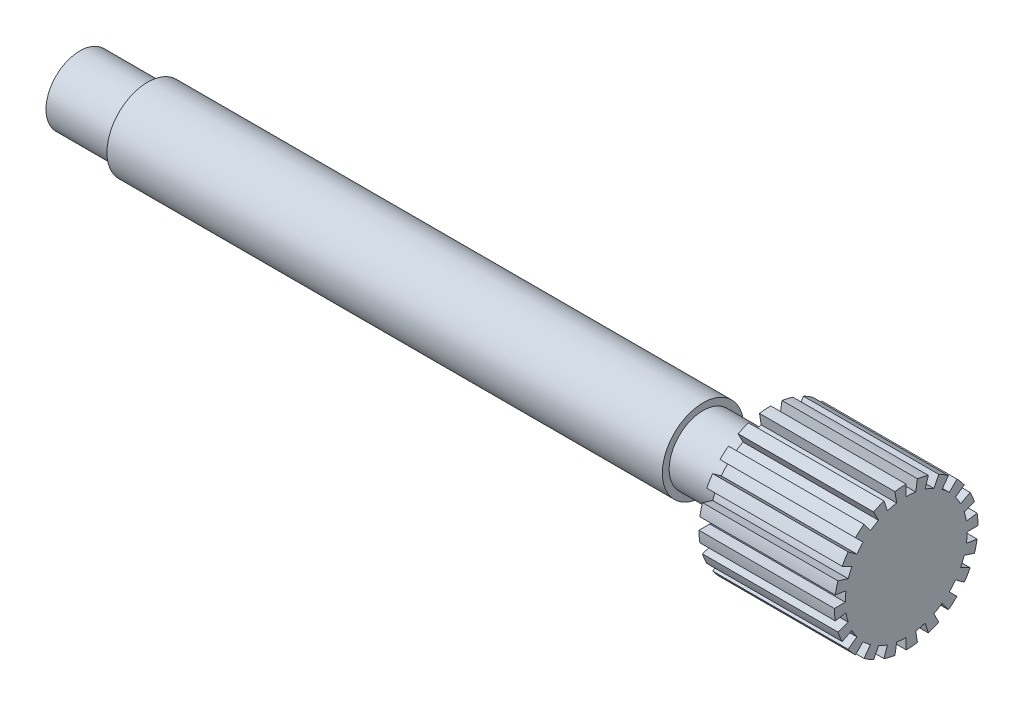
ISO-10303-21;
HEADER;
FILE_DESCRIPTION(('STEP AP214'),'2;1');
FILE_NAME('part.step','',(''),(''),'','','');
FILE_SCHEMA(('AUTOMOTIVE_DESIGN { 1 0 10303 214 1 1 1 1 }'));
ENDSEC;
DATA;
#1=APPLICATION_CONTEXT('core data for automotive mechanical design processes');
#2=APPLICATION_PROTOCOL_DEFINITION('international standard','automotive_design',2000,#1);
#3=PRODUCT_CONTEXT('',#1,'mechanical');
#4=PRODUCT('Part','Part','',(#3));
#5=PRODUCT_RELATED_PRODUCT_CATEGORY('part','',(#4));
#6=PRODUCT_DEFINITION_FORMATION('','',#4);
#7=PRODUCT_DEFINITION_CONTEXT('part definition',#1,'design');
#8=PRODUCT_DEFINITION('design','',#6,#7);
#9=PRODUCT_DEFINITION_SHAPE('','',#8);
#10=(LENGTH_UNIT() NAMED_UNIT(*) SI_UNIT(.MILLI.,.METRE.));
#11=(NAMED_UNIT(*) PLANE_ANGLE_UNIT() SI_UNIT($,.RADIAN.));
#12=(NAMED_UNIT(*) SI_UNIT($,.STERADIAN.) SOLID_ANGLE_UNIT());
#13=UNCERTAINTY_MEASURE_WITH_UNIT(LENGTH_MEASURE(1.E-05),#10,'distance_accuracy_value','');
#14=(GEOMETRIC_REPRESENTATION_CONTEXT(3) GLOBAL_UNCERTAINTY_ASSIGNED_CONTEXT((#13)) GLOBAL_UNIT_ASSIGNED_CONTEXT((#10,
#11,#12)) REPRESENTATION_CONTEXT('',''));
#15=CARTESIAN_POINT('',(0.,0.,0.));
#16=DIRECTION('',(0.,0.,1.));
#17=DIRECTION('',(1.,0.,0.));
#18=AXIS2_PLACEMENT_3D('',#15,#16,#17);
#19=CARTESIAN_POINT('',(-31.6434381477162,0.,0.));
#20=DIRECTION('',(-1.,0.,0.));
#21=DIRECTION('',(0.,0.,1.));
#22=AXIS2_PLACEMENT_3D('',#19,#20,#21);
#23=CYLINDRICAL_SURFACE('',#22,2.5);
#24=CARTESIAN_POINT('',(46.,0.,0.));
#25=DIRECTION('',(-1.,0.,0.));
#26=DIRECTION('',(0.,0.,1.));
#27=AXIS2_PLACEMENT_3D('',#24,#25,#26);
#28=CIRCLE('',#27,2.5);
#29=CARTESIAN_POINT('',(46.,0.,2.5));
#30=VERTEX_POINT('',#29);
#31=EDGE_CURVE('E805',#30,#30,#28,.T.);
#32=ORIENTED_EDGE('',*,*,#31,.F.);
#33=EDGE_LOOP('',(#32));
#34=FACE_BOUND('',#33,.T.);
#35=CARTESIAN_POINT('',(51.,0.,0.));
#36=DIRECTION('',(1.,0.,0.));
#37=DIRECTION('',(0.,0.,-1.));
#38=AXIS2_PLACEMENT_3D('',#35,#36,#37);
#39=CIRCLE('',#38,2.5);
#40=CARTESIAN_POINT('',(51.,0.,-2.5));
#41=VERTEX_POINT('',#40);
#42=EDGE_CURVE('E11',#41,#41,#39,.T.);
#43=ORIENTED_EDGE('',*,*,#42,.F.);
#44=EDGE_LOOP('',(#43));
#45=FACE_BOUND('',#44,.T.);
#46=ADVANCED_FACE('F34',(#34,#45),#23,.T.);
#47=CARTESIAN_POINT('',(0.,0.,0.));
#48=DIRECTION('',(1.,0.,0.));
#49=DIRECTION('',(0.,0.,-1.));
#50=AXIS2_PLACEMENT_3D('',#47,#48,#49);
#51=PLANE('',#50);
#52=CARTESIAN_POINT('',(0.,0.,0.));
#53=DIRECTION('',(-1.,0.,0.));
#54=DIRECTION('',(0.,0.,1.));
#55=AXIS2_PLACEMENT_3D('',#52,#53,#54);
#56=CIRCLE('',#55,2.5);
#57=CARTESIAN_POINT('',(0.,0.,2.5));
#58=VERTEX_POINT('',#57);
#59=EDGE_CURVE('E43',#58,#58,#56,.T.);
#60=ORIENTED_EDGE('',*,*,#59,.T.);
#61=EDGE_LOOP('',(#60));
#62=FACE_BOUND('',#61,.T.);
#63=ADVANCED_FACE('F36',(#62),#51,.F.);
#64=CARTESIAN_POINT('',(-31.6434381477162,0.,0.));
#65=DIRECTION('',(-1.,0.,0.));
#66=DIRECTION('',(0.,0.,1.));
#67=AXIS2_PLACEMENT_3D('',#64,#65,#66);
#68=CYLINDRICAL_SURFACE('',#67,2.5);
#69=ORIENTED_EDGE('',*,*,#59,.F.);
#70=EDGE_LOOP('',(#69));
#71=FACE_BOUND('',#70,.T.);
#72=CARTESIAN_POINT('',(5.,0.,0.));
#73=DIRECTION('',(-1.,0.,0.));
#74=DIRECTION('',(0.,0.,1.));
#75=AXIS2_PLACEMENT_3D('',#72,#73,#74);
#76=CIRCLE('',#75,2.5);
#77=CARTESIAN_POINT('',(5.,0.,2.5));
#78=VERTEX_POINT('',#77);
#79=EDGE_CURVE('E967',#78,#78,#76,.T.);
#80=ORIENTED_EDGE('',*,*,#79,.T.);
#81=EDGE_LOOP('',(#80));
#82=FACE_BOUND('',#81,.T.);
#83=ADVANCED_FACE('F973',(#71,#82),#68,.T.);
#84=CARTESIAN_POINT('',(5.,2.5,0.));
#85=DIRECTION('',(1.,0.,0.));
#86=DIRECTION('',(0.,0.,-1.));
#87=AXIS2_PLACEMENT_3D('',#84,#85,#86);
#88=PLANE('',#87);
#89=ORIENTED_EDGE('',*,*,#79,.F.);
#90=EDGE_LOOP('',(#89));
#91=FACE_BOUND('',#90,.T.);
#92=CARTESIAN_POINT('',(5.,0.,0.));
#93=DIRECTION('',(-1.,0.,0.));
#94=DIRECTION('',(0.,0.,1.));
#95=AXIS2_PLACEMENT_3D('',#92,#93,#94);
#96=CIRCLE('',#95,3.);
#97=CARTESIAN_POINT('',(5.,0.,3.));
#98=VERTEX_POINT('',#97);
#99=EDGE_CURVE('E964',#98,#98,#96,.T.);
#100=ORIENTED_EDGE('',*,*,#99,.T.);
#101=EDGE_LOOP('',(#100));
#102=FACE_BOUND('',#101,.T.);
#103=ADVANCED_FACE('F976',(#91,#102),#88,.F.);
#104=CARTESIAN_POINT('',(-31.6434381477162,0.,0.));
#105=DIRECTION('',(-1.,0.,0.));
#106=DIRECTION('',(0.,0.,1.));
#107=AXIS2_PLACEMENT_3D('',#104,#105,#106);
#108=CYLINDRICAL_SURFACE('',#107,3.);
#109=ORIENTED_EDGE('',*,*,#99,.F.);
#110=EDGE_LOOP('',(#109));
#111=FACE_BOUND('',#110,.T.);
#112=CARTESIAN_POINT('',(46.,0.,0.));
#113=DIRECTION('',(-1.,0.,0.));
#114=DIRECTION('',(0.,0.,1.));
#115=AXIS2_PLACEMENT_3D('',#112,#113,#114);
#116=CIRCLE('',#115,3.);
#117=CARTESIAN_POINT('',(46.,0.,3.));
#118=VERTEX_POINT('',#117);
#119=EDGE_CURVE('E961',#118,#118,#116,.T.);
#120=ORIENTED_EDGE('',*,*,#119,.T.);
#121=EDGE_LOOP('',(#120));
#122=FACE_BOUND('',#121,.T.);
#123=ADVANCED_FACE('F981',(#111,#122),#108,.T.);
#124=CARTESIAN_POINT('',(46.,3.,0.));
#125=DIRECTION('',(-1.,0.,0.));
#126=DIRECTION('',(0.,0.,1.));
#127=AXIS2_PLACEMENT_3D('',#124,#125,#126);
#128=PLANE('',#127);
#129=ORIENTED_EDGE('',*,*,#119,.F.);
#130=EDGE_LOOP('',(#129));
#131=FACE_BOUND('',#130,.T.);
#132=ORIENTED_EDGE('',*,*,#31,.T.);
#133=EDGE_LOOP('',(#132));
#134=FACE_BOUND('',#133,.T.);
#135=ADVANCED_FACE('F987',(#131,#134),#128,.F.);
#136=CARTESIAN_POINT('',(51.,0.,0.));
#137=DIRECTION('',(1.,0.,0.));
#138=DIRECTION('',(0.,0.,-1.));
#139=AXIS2_PLACEMENT_3D('',#136,#137,#138);
#140=CYLINDRICAL_SURFACE('',#139,4.5);
#141=CARTESIAN_POINT('',(61.,0.,0.));
#142=DIRECTION('',(1.,0.,0.));
#143=DIRECTION('',(0.,0.,-1.));
#144=AXIS2_PLACEMENT_3D('',#141,#142,#143);
#145=CIRCLE('',#144,4.5);
#146=CARTESIAN_POINT('',(61.,0.703955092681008,-4.44459753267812));
#147=VERTEX_POINT('',#146);
#148=CARTESIAN_POINT('',(61.,1.39057647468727,-4.27975432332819));
#149=VERTEX_POINT('',#148);
#150=EDGE_CURVE('E566',#147,#149,#145,.T.);
#151=ORIENTED_EDGE('',*,*,#150,.F.);
#152=DIRECTION('',(1.,0.,0.));
#153=VECTOR('',#152,1.);
#154=CARTESIAN_POINT('',(51.,0.703955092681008,-4.44459753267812));
#155=LINE('',#154,#153);
#156=CARTESIAN_POINT('',(51.,0.703955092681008,-4.44459753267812));
#157=VERTEX_POINT('',#156);
#158=EDGE_CURVE('E51',#157,#147,#155,.T.);
#159=ORIENTED_EDGE('',*,*,#158,.F.);
#160=CARTESIAN_POINT('',(51.,0.,0.));
#161=DIRECTION('',(1.,0.,0.));
#162=DIRECTION('',(0.,0.,-1.));
#163=AXIS2_PLACEMENT_3D('',#160,#161,#162);
#164=CIRCLE('',#163,4.5);
#165=CARTESIAN_POINT('',(51.,1.39057647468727,-4.27975432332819));
#166=VERTEX_POINT('',#165);
#167=EDGE_CURVE('E803',#157,#166,#164,.T.);
#168=ORIENTED_EDGE('',*,*,#167,.T.);
#169=DIRECTION('',(1.,0.,0.));
#170=VECTOR('',#169,1.);
#171=CARTESIAN_POINT('',(51.,1.39057647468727,-4.27975432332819));
#172=LINE('',#171,#170);
#173=EDGE_CURVE('E308',#166,#149,#172,.T.);
#174=ORIENTED_EDGE('',*,*,#173,.T.);
#175=EDGE_LOOP('',(#151,#159,#168,#174));
#176=FACE_BOUND('',#175,.T.);
#177=ADVANCED_FACE('F993',(#176),#140,.T.);
#178=CARTESIAN_POINT('',(51.,0.703955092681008,-4.44459753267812));
#179=DIRECTION('',(0.,0.987688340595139,0.156434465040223));
#180=DIRECTION('',(0.,-0.156434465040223,0.987688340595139));
#181=AXIS2_PLACEMENT_3D('',#178,#179,#180);
#182=PLANE('',#181);
#183=DIRECTION('',(0.,-0.156434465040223,0.987688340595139));
#184=VECTOR('',#183,1.);
#185=CARTESIAN_POINT('',(61.,0.703955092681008,-4.44459753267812));
#186=LINE('',#185,#184);
#187=CARTESIAN_POINT('',(61.,0.829102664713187,-5.23474820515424));
#188=VERTEX_POINT('',#187);
#189=EDGE_CURVE('E800',#188,#147,#186,.T.);
#190=ORIENTED_EDGE('',*,*,#189,.F.);
#191=DIRECTION('',(1.,0.,0.));
#192=VECTOR('',#191,1.);
#193=CARTESIAN_POINT('',(51.,0.829102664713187,-5.23474820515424));
#194=LINE('',#193,#192);
#195=CARTESIAN_POINT('',(51.,0.829102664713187,-5.23474820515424));
#196=VERTEX_POINT('',#195);
#197=EDGE_CURVE('E296',#196,#188,#194,.T.);
#198=ORIENTED_EDGE('',*,*,#197,.F.);
#199=DIRECTION('',(0.,-0.156434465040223,0.987688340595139));
#200=VECTOR('',#199,1.);
#201=CARTESIAN_POINT('',(51.,0.703955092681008,-4.44459753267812));
#202=LINE('',#201,#200);
#203=EDGE_CURVE('E556',#196,#157,#202,.T.);
#204=ORIENTED_EDGE('',*,*,#203,.T.);
#205=ORIENTED_EDGE('',*,*,#158,.T.);
#206=EDGE_LOOP('',(#190,#198,#204,#205));
#207=FACE_BOUND('',#206,.T.);
#208=ADVANCED_FACE('F1015',(#207),#182,.T.);
#209=CARTESIAN_POINT('',(51.,0.,0.));
#210=DIRECTION('',(1.,0.,0.));
#211=DIRECTION('',(0.,0.,-1.));
#212=AXIS2_PLACEMENT_3D('',#209,#210,#211);
#213=CYLINDRICAL_SURFACE('',#212,5.3);
#214=CARTESIAN_POINT('',(61.,0.,0.));
#215=DIRECTION('',(1.,0.,0.));
#216=DIRECTION('',(0.,0.,-1.));
#217=AXIS2_PLACEMENT_3D('',#214,#215,#216);
#218=CIRCLE('',#217,5.3);
#219=CARTESIAN_POINT('',(61.,0.,-5.3));
#220=VERTEX_POINT('',#219);
#221=EDGE_CURVE('E543',#220,#188,#218,.T.);
#222=ORIENTED_EDGE('',*,*,#221,.F.);
#223=DIRECTION('',(1.,0.,0.));
#224=VECTOR('',#223,1.);
#225=CARTESIAN_POINT('',(51.,0.,-5.3));
#226=LINE('',#225,#224);
#227=CARTESIAN_POINT('',(51.,0.,-5.3));
#228=VERTEX_POINT('',#227);
#229=EDGE_CURVE('E538',#228,#220,#226,.T.);
#230=ORIENTED_EDGE('',*,*,#229,.F.);
#231=CARTESIAN_POINT('',(51.,0.,0.));
#232=DIRECTION('',(1.,0.,0.));
#233=DIRECTION('',(0.,0.,-1.));
#234=AXIS2_PLACEMENT_3D('',#231,#232,#233);
#235=CIRCLE('',#234,5.3);
#236=EDGE_CURVE('E541',#228,#196,#235,.T.);
#237=ORIENTED_EDGE('',*,*,#236,.T.);
#238=ORIENTED_EDGE('',*,*,#197,.T.);
#239=EDGE_LOOP('',(#222,#230,#237,#238));
#240=FACE_BOUND('',#239,.T.);
#241=ADVANCED_FACE('F540',(#240),#213,.T.);
#242=CARTESIAN_POINT('',(51.,0.,-4.5));
#243=DIRECTION('',(0.,-1.,0.));
#244=DIRECTION('',(0.,0.,-1.));
#245=AXIS2_PLACEMENT_3D('',#242,#243,#244);
#246=PLANE('',#245);
#247=DIRECTION('',(0.,0.,-1.));
#248=VECTOR('',#247,1.);
#249=CARTESIAN_POINT('',(61.,0.,-4.5));
#250=LINE('',#249,#248);
#251=CARTESIAN_POINT('',(61.,0.,-4.5));
#252=VERTEX_POINT('',#251);
#253=EDGE_CURVE('E797',#252,#220,#250,.T.);
#254=ORIENTED_EDGE('',*,*,#253,.F.);
#255=DIRECTION('',(1.,0.,0.));
#256=VECTOR('',#255,1.);
#257=CARTESIAN_POINT('',(51.,0.,-4.5));
#258=LINE('',#257,#256);
#259=CARTESIAN_POINT('',(51.,0.,-4.5));
#260=VERTEX_POINT('',#259);
#261=EDGE_CURVE('E548',#260,#252,#258,.T.);
#262=ORIENTED_EDGE('',*,*,#261,.F.);
#263=DIRECTION('',(0.,0.,-1.));
#264=VECTOR('',#263,1.);
#265=CARTESIAN_POINT('',(51.,0.,-4.5));
#266=LINE('',#265,#264);
#267=EDGE_CURVE('E554',#260,#228,#266,.T.);
#268=ORIENTED_EDGE('',*,*,#267,.T.);
#269=ORIENTED_EDGE('',*,*,#229,.T.);
#270=EDGE_LOOP('',(#254,#262,#268,#269));
#271=FACE_BOUND('',#270,.T.);
#272=ADVANCED_FACE('F558',(#271),#246,.T.);
#273=CARTESIAN_POINT('',(51.,0.,0.));
#274=DIRECTION('',(1.,0.,0.));
#275=DIRECTION('',(0.,0.,-1.));
#276=AXIS2_PLACEMENT_3D('',#273,#274,#275);
#277=CYLINDRICAL_SURFACE('',#276,4.5);
#278=CARTESIAN_POINT('',(61.,0.,0.));
#279=DIRECTION('',(1.,0.,0.));
#280=DIRECTION('',(0.,0.,-1.));
#281=AXIS2_PLACEMENT_3D('',#278,#279,#280);
#282=CIRCLE('',#281,4.5);
#283=CARTESIAN_POINT('',(61.,-0.70395509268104,-4.44459753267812));
#284=VERTEX_POINT('',#283);
#285=EDGE_CURVE('E794',#284,#252,#282,.T.);
#286=ORIENTED_EDGE('',*,*,#285,.F.);
#287=DIRECTION('',(1.,0.,0.));
#288=VECTOR('',#287,1.);
#289=CARTESIAN_POINT('',(51.,-0.70395509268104,-4.44459753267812));
#290=LINE('',#289,#288);
#291=CARTESIAN_POINT('',(51.,-0.70395509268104,-4.44459753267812));
#292=VERTEX_POINT('',#291);
#293=EDGE_CURVE('E808',#292,#284,#290,.T.);
#294=ORIENTED_EDGE('',*,*,#293,.F.);
#295=CARTESIAN_POINT('',(51.,0.,0.));
#296=DIRECTION('',(1.,0.,0.));
#297=DIRECTION('',(0.,0.,-1.));
#298=AXIS2_PLACEMENT_3D('',#295,#296,#297);
#299=CIRCLE('',#298,4.5);
#300=EDGE_CURVE('E559',#292,#260,#299,.T.);
#301=ORIENTED_EDGE('',*,*,#300,.T.);
#302=ORIENTED_EDGE('',*,*,#261,.T.);
#303=EDGE_LOOP('',(#286,#294,#301,#302));
#304=FACE_BOUND('',#303,.T.);
#305=ADVANCED_FACE('F1022',(#304),#277,.T.);
#306=CARTESIAN_POINT('',(51.,-0.703955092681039,-4.44459753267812));
#307=DIRECTION('',(0.,0.987688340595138,-0.156434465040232));
#308=DIRECTION('',(0.,0.156434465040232,0.987688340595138));
#309=AXIS2_PLACEMENT_3D('',#306,#307,#308);
#310=PLANE('',#309);
#311=DIRECTION('',(0.,0.156434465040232,0.987688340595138));
#312=VECTOR('',#311,1.);
#313=CARTESIAN_POINT('',(61.,-0.703955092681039,-4.44459753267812));
#314=LINE('',#313,#312);
#315=CARTESIAN_POINT('',(61.,-0.829102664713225,-5.23474820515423));
#316=VERTEX_POINT('',#315);
#317=EDGE_CURVE('E791',#316,#284,#314,.T.);
#318=ORIENTED_EDGE('',*,*,#317,.F.);
#319=DIRECTION('',(1.,0.,0.));
#320=VECTOR('',#319,1.);
#321=CARTESIAN_POINT('',(51.,-0.829102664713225,-5.23474820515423));
#322=LINE('',#321,#320);
#323=CARTESIAN_POINT('',(51.,-0.829102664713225,-5.23474820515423));
#324=VERTEX_POINT('',#323);
#325=EDGE_CURVE('E810',#324,#316,#322,.T.);
#326=ORIENTED_EDGE('',*,*,#325,.F.);
#327=DIRECTION('',(0.,0.156434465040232,0.987688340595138));
#328=VECTOR('',#327,1.);
#329=CARTESIAN_POINT('',(51.,-0.703955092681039,-4.44459753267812));
#330=LINE('',#329,#328);
#331=EDGE_CURVE('E561',#324,#292,#330,.T.);
#332=ORIENTED_EDGE('',*,*,#331,.T.);
#333=ORIENTED_EDGE('',*,*,#293,.T.);
#334=EDGE_LOOP('',(#318,#326,#332,#333));
#335=FACE_BOUND('',#334,.T.);
#336=ADVANCED_FACE('F1025',(#335),#310,.T.);
#337=CARTESIAN_POINT('',(51.,0.,0.));
#338=DIRECTION('',(1.,0.,0.));
#339=DIRECTION('',(0.,0.,-1.));
#340=AXIS2_PLACEMENT_3D('',#337,#338,#339);
#341=CYLINDRICAL_SURFACE('',#340,5.3);
#342=CARTESIAN_POINT('',(61.,0.,0.));
#343=DIRECTION('',(1.,0.,0.));
#344=DIRECTION('',(0.,0.,-1.));
#345=AXIS2_PLACEMENT_3D('',#342,#343,#344);
#346=CIRCLE('',#345,5.3);
#347=CARTESIAN_POINT('',(61.,-1.63779007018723,-5.04059953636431));
#348=VERTEX_POINT('',#347);
#349=EDGE_CURVE('E788',#348,#316,#346,.T.);
#350=ORIENTED_EDGE('',*,*,#349,.F.);
#351=DIRECTION('',(1.,0.,0.));
#352=VECTOR('',#351,1.);
#353=CARTESIAN_POINT('',(51.,-1.63779007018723,-5.04059953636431));
#354=LINE('',#353,#352);
#355=CARTESIAN_POINT('',(51.,-1.63779007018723,-5.04059953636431));
#356=VERTEX_POINT('',#355);
#357=EDGE_CURVE('E812',#356,#348,#354,.T.);
#358=ORIENTED_EDGE('',*,*,#357,.F.);
#359=CARTESIAN_POINT('',(51.,0.,0.));
#360=DIRECTION('',(1.,0.,0.));
#361=DIRECTION('',(0.,0.,-1.));
#362=AXIS2_PLACEMENT_3D('',#359,#360,#361);
#363=CIRCLE('',#362,5.3);
#364=EDGE_CURVE('E1330',#356,#324,#363,.T.);
#365=ORIENTED_EDGE('',*,*,#364,.T.);
#366=ORIENTED_EDGE('',*,*,#325,.T.);
#367=EDGE_LOOP('',(#350,#358,#365,#366));
#368=FACE_BOUND('',#367,.T.);
#369=ADVANCED_FACE('F1029',(#368),#341,.T.);
#370=CARTESIAN_POINT('',(51.,-1.39057647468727,-4.27975432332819));
#371=DIRECTION('',(0.,-0.951056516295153,0.309016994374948));
#372=DIRECTION('',(0.,-0.309016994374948,-0.951056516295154));
#373=AXIS2_PLACEMENT_3D('',#370,#371,#372);
#374=PLANE('',#373);
#375=DIRECTION('',(0.,-0.309016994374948,-0.951056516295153));
#376=VECTOR('',#375,1.);
#377=CARTESIAN_POINT('',(61.,-1.39057647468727,-4.27975432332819));
#378=LINE('',#377,#376);
#379=CARTESIAN_POINT('',(61.,-1.39057647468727,-4.27975432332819));
#380=VERTEX_POINT('',#379);
#381=EDGE_CURVE('E785',#380,#348,#378,.T.);
#382=ORIENTED_EDGE('',*,*,#381,.F.);
#383=DIRECTION('',(1.,0.,0.));
#384=VECTOR('',#383,1.);
#385=CARTESIAN_POINT('',(51.,-1.39057647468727,-4.27975432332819));
#386=LINE('',#385,#384);
#387=CARTESIAN_POINT('',(51.,-1.39057647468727,-4.27975432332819));
#388=VERTEX_POINT('',#387);
#389=EDGE_CURVE('E814',#388,#380,#386,.T.);
#390=ORIENTED_EDGE('',*,*,#389,.F.);
#391=DIRECTION('',(0.,-0.309016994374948,-0.951056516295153));
#392=VECTOR('',#391,1.);
#393=CARTESIAN_POINT('',(51.,-1.39057647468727,-4.27975432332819));
#394=LINE('',#393,#392);
#395=EDGE_CURVE('E1331',#388,#356,#394,.T.);
#396=ORIENTED_EDGE('',*,*,#395,.T.);
#397=ORIENTED_EDGE('',*,*,#357,.T.);
#398=EDGE_LOOP('',(#382,#390,#396,#397));
#399=FACE_BOUND('',#398,.T.);
#400=ADVANCED_FACE('F1033',(#399),#374,.T.);
#401=CARTESIAN_POINT('',(51.,0.,0.));
#402=DIRECTION('',(1.,0.,0.));
#403=DIRECTION('',(0.,0.,-1.));
#404=AXIS2_PLACEMENT_3D('',#401,#402,#403);
#405=CYLINDRICAL_SURFACE('',#404,4.5);
#406=CARTESIAN_POINT('',(61.,0.,0.));
#407=DIRECTION('',(1.,0.,0.));
#408=DIRECTION('',(0.,0.,-1.));
#409=AXIS2_PLACEMENT_3D('',#406,#407,#408);
#410=CIRCLE('',#409,4.5);
#411=CARTESIAN_POINT('',(61.,-2.04295724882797,-4.00952935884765));
#412=VERTEX_POINT('',#411);
#413=EDGE_CURVE('E782',#412,#380,#410,.T.);
#414=ORIENTED_EDGE('',*,*,#413,.F.);
#415=DIRECTION('',(1.,0.,0.));
#416=VECTOR('',#415,1.);
#417=CARTESIAN_POINT('',(51.,-2.04295724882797,-4.00952935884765));
#418=LINE('',#417,#416);
#419=CARTESIAN_POINT('',(51.,-2.04295724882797,-4.00952935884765));
#420=VERTEX_POINT('',#419);
#421=EDGE_CURVE('E816',#420,#412,#418,.T.);
#422=ORIENTED_EDGE('',*,*,#421,.F.);
#423=CARTESIAN_POINT('',(51.,0.,0.));
#424=DIRECTION('',(1.,0.,0.));
#425=DIRECTION('',(0.,0.,-1.));
#426=AXIS2_PLACEMENT_3D('',#423,#424,#425);
#427=CIRCLE('',#426,4.5);
#428=EDGE_CURVE('E1336',#420,#388,#427,.T.);
#429=ORIENTED_EDGE('',*,*,#428,.T.);
#430=ORIENTED_EDGE('',*,*,#389,.T.);
#431=EDGE_LOOP('',(#414,#422,#429,#430));
#432=FACE_BOUND('',#431,.T.);
#433=ADVANCED_FACE('F1037',(#432),#405,.T.);
#434=CARTESIAN_POINT('',(51.,-2.04295724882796,-4.00952935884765));
#435=DIRECTION('',(0.,0.891006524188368,-0.453990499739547));
#436=DIRECTION('',(0.,0.453990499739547,0.891006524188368));
#437=AXIS2_PLACEMENT_3D('',#434,#435,#436);
#438=PLANE('',#437);
#439=DIRECTION('',(0.,0.453990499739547,0.891006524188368));
#440=VECTOR('',#439,1.);
#441=CARTESIAN_POINT('',(61.,-2.04295724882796,-4.00952935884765));
#442=LINE('',#441,#440);
#443=CARTESIAN_POINT('',(61.,-2.4061496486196,-4.72233457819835));
#444=VERTEX_POINT('',#443);
#445=EDGE_CURVE('E779',#444,#412,#442,.T.);
#446=ORIENTED_EDGE('',*,*,#445,.F.);
#447=DIRECTION('',(1.,0.,0.));
#448=VECTOR('',#447,1.);
#449=CARTESIAN_POINT('',(51.,-2.4061496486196,-4.72233457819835));
#450=LINE('',#449,#448);
#451=CARTESIAN_POINT('',(51.,-2.4061496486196,-4.72233457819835));
#452=VERTEX_POINT('',#451);
#453=EDGE_CURVE('E818',#452,#444,#450,.T.);
#454=ORIENTED_EDGE('',*,*,#453,.F.);
#455=DIRECTION('',(0.,0.453990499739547,0.891006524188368));
#456=VECTOR('',#455,1.);
#457=CARTESIAN_POINT('',(51.,-2.04295724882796,-4.00952935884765));
#458=LINE('',#457,#456);
#459=EDGE_CURVE('E1339',#452,#420,#458,.T.);
#460=ORIENTED_EDGE('',*,*,#459,.T.);
#461=ORIENTED_EDGE('',*,*,#421,.T.);
#462=EDGE_LOOP('',(#446,#454,#460,#461));
#463=FACE_BOUND('',#462,.T.);
#464=ADVANCED_FACE('F1041',(#463),#438,.T.);
#465=CARTESIAN_POINT('',(51.,0.,0.));
#466=DIRECTION('',(1.,0.,0.));
#467=DIRECTION('',(0.,0.,-1.));
#468=AXIS2_PLACEMENT_3D('',#465,#466,#467);
#469=CYLINDRICAL_SURFACE('',#468,5.3);
#470=CARTESIAN_POINT('',(61.,0.,0.));
#471=DIRECTION('',(1.,0.,0.));
#472=DIRECTION('',(0.,0.,-1.));
#473=AXIS2_PLACEMENT_3D('',#470,#471,#472);
#474=CIRCLE('',#473,5.3);
#475=CARTESIAN_POINT('',(61.,-3.11526183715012,-4.28779007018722));
#476=VERTEX_POINT('',#475);
#477=EDGE_CURVE('E776',#476,#444,#474,.T.);
#478=ORIENTED_EDGE('',*,*,#477,.F.);
#479=DIRECTION('',(1.,0.,0.));
#480=VECTOR('',#479,1.);
#481=CARTESIAN_POINT('',(51.,-3.11526183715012,-4.28779007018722));
#482=LINE('',#481,#480);
#483=CARTESIAN_POINT('',(51.,-3.11526183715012,-4.28779007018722));
#484=VERTEX_POINT('',#483);
#485=EDGE_CURVE('E820',#484,#476,#482,.T.);
#486=ORIENTED_EDGE('',*,*,#485,.F.);
#487=CARTESIAN_POINT('',(51.,0.,0.));
#488=DIRECTION('',(1.,0.,0.));
#489=DIRECTION('',(0.,0.,-1.));
#490=AXIS2_PLACEMENT_3D('',#487,#488,#489);
#491=CIRCLE('',#490,5.3);
#492=EDGE_CURVE('E1342',#484,#452,#491,.T.);
#493=ORIENTED_EDGE('',*,*,#492,.T.);
#494=ORIENTED_EDGE('',*,*,#453,.T.);
#495=EDGE_LOOP('',(#478,#486,#493,#494));
#496=FACE_BOUND('',#495,.T.);
#497=ADVANCED_FACE('F1045',(#496),#469,.T.);
#498=CARTESIAN_POINT('',(51.,-2.64503363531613,-3.64057647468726));
#499=DIRECTION('',(0.,-0.809016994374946,0.587785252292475));
#500=DIRECTION('',(0.,-0.587785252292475,-0.809016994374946));
#501=AXIS2_PLACEMENT_3D('',#498,#499,#500);
#502=PLANE('',#501);
#503=DIRECTION('',(0.,-0.587785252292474,-0.809016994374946));
#504=VECTOR('',#503,1.);
#505=CARTESIAN_POINT('',(61.,-2.64503363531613,-3.64057647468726));
#506=LINE('',#505,#504);
#507=CARTESIAN_POINT('',(61.,-2.64503363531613,-3.64057647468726));
#508=VERTEX_POINT('',#507);
#509=EDGE_CURVE('E773',#508,#476,#506,.T.);
#510=ORIENTED_EDGE('',*,*,#509,.F.);
#511=DIRECTION('',(1.,0.,0.));
#512=VECTOR('',#511,1.);
#513=CARTESIAN_POINT('',(51.,-2.64503363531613,-3.64057647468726));
#514=LINE('',#513,#512);
#515=CARTESIAN_POINT('',(51.,-2.64503363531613,-3.64057647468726));
#516=VERTEX_POINT('',#515);
#517=EDGE_CURVE('E822',#516,#508,#514,.T.);
#518=ORIENTED_EDGE('',*,*,#517,.F.);
#519=DIRECTION('',(0.,-0.587785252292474,-0.809016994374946));
#520=VECTOR('',#519,1.);
#521=CARTESIAN_POINT('',(51.,-2.64503363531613,-3.64057647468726));
#522=LINE('',#521,#520);
#523=EDGE_CURVE('E1345',#516,#484,#522,.T.);
#524=ORIENTED_EDGE('',*,*,#523,.T.);
#525=ORIENTED_EDGE('',*,*,#485,.T.);
#526=EDGE_LOOP('',(#510,#518,#524,#525));
#527=FACE_BOUND('',#526,.T.);
#528=ADVANCED_FACE('F1049',(#527),#502,.T.);
#529=CARTESIAN_POINT('',(51.,0.,0.));
#530=DIRECTION('',(1.,0.,0.));
#531=DIRECTION('',(0.,0.,-1.));
#532=AXIS2_PLACEMENT_3D('',#529,#530,#531);
#533=CYLINDRICAL_SURFACE('',#532,4.5);
#534=CARTESIAN_POINT('',(61.,0.,0.));
#535=DIRECTION('',(1.,0.,0.));
#536=DIRECTION('',(0.,0.,-1.));
#537=AXIS2_PLACEMENT_3D('',#534,#535,#536);
#538=CIRCLE('',#537,4.5);
#539=CARTESIAN_POINT('',(61.,-3.18198051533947,-3.18198051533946));
#540=VERTEX_POINT('',#539);
#541=EDGE_CURVE('E770',#540,#508,#538,.T.);
#542=ORIENTED_EDGE('',*,*,#541,.F.);
#543=DIRECTION('',(1.,0.,0.));
#544=VECTOR('',#543,1.);
#545=CARTESIAN_POINT('',(51.,-3.18198051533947,-3.18198051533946));
#546=LINE('',#545,#544);
#547=CARTESIAN_POINT('',(51.,-3.18198051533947,-3.18198051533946));
#548=VERTEX_POINT('',#547);
#549=EDGE_CURVE('E824',#548,#540,#546,.T.);
#550=ORIENTED_EDGE('',*,*,#549,.F.);
#551=CARTESIAN_POINT('',(51.,0.,0.));
#552=DIRECTION('',(1.,0.,0.));
#553=DIRECTION('',(0.,0.,-1.));
#554=AXIS2_PLACEMENT_3D('',#551,#552,#553);
#555=CIRCLE('',#554,4.5);
#556=EDGE_CURVE('E1348',#548,#516,#555,.T.);
#557=ORIENTED_EDGE('',*,*,#556,.T.);
#558=ORIENTED_EDGE('',*,*,#517,.T.);
#559=EDGE_LOOP('',(#542,#550,#557,#558));
#560=FACE_BOUND('',#559,.T.);
#561=ADVANCED_FACE('F1053',(#560),#533,.T.);
#562=CARTESIAN_POINT('',(51.,-3.18198051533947,-3.18198051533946));
#563=DIRECTION('',(0.,0.707106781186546,-0.707106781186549));
#564=DIRECTION('',(0.,0.707106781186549,0.707106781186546));
#565=AXIS2_PLACEMENT_3D('',#562,#563,#564);
#566=PLANE('',#565);
#567=DIRECTION('',(0.,0.707106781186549,0.707106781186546));
#568=VECTOR('',#567,1.);
#569=CARTESIAN_POINT('',(61.,-3.18198051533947,-3.18198051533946));
#570=LINE('',#569,#568);
#571=CARTESIAN_POINT('',(61.,-3.74766594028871,-3.7476659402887));
#572=VERTEX_POINT('',#571);
#573=EDGE_CURVE('E767',#572,#540,#570,.T.);
#574=ORIENTED_EDGE('',*,*,#573,.F.);
#575=DIRECTION('',(1.,0.,0.));
#576=VECTOR('',#575,1.);
#577=CARTESIAN_POINT('',(51.,-3.74766594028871,-3.7476659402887));
#578=LINE('',#577,#576);
#579=CARTESIAN_POINT('',(51.,-3.74766594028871,-3.7476659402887));
#580=VERTEX_POINT('',#579);
#581=EDGE_CURVE('E826',#580,#572,#578,.T.);
#582=ORIENTED_EDGE('',*,*,#581,.F.);
#583=DIRECTION('',(0.,0.707106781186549,0.707106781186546));
#584=VECTOR('',#583,1.);
#585=CARTESIAN_POINT('',(51.,-3.18198051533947,-3.18198051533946));
#586=LINE('',#585,#584);
#587=EDGE_CURVE('E1351',#580,#548,#586,.T.);
#588=ORIENTED_EDGE('',*,*,#587,.T.);
#589=ORIENTED_EDGE('',*,*,#549,.T.);
#590=EDGE_LOOP('',(#574,#582,#588,#589));
#591=FACE_BOUND('',#590,.T.);
#592=ADVANCED_FACE('F1057',(#591),#566,.T.);
#593=CARTESIAN_POINT('',(51.,0.,0.));
#594=DIRECTION('',(1.,0.,0.));
#595=DIRECTION('',(0.,0.,-1.));
#596=AXIS2_PLACEMENT_3D('',#593,#594,#595);
#597=CYLINDRICAL_SURFACE('',#596,5.3);
#598=CARTESIAN_POINT('',(61.,0.,0.));
#599=DIRECTION('',(1.,0.,0.));
#600=DIRECTION('',(0.,0.,-1.));
#601=AXIS2_PLACEMENT_3D('',#598,#599,#600);
#602=CIRCLE('',#601,5.3);
#603=CARTESIAN_POINT('',(61.,-4.28779007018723,-3.1152618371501));
#604=VERTEX_POINT('',#603);
#605=EDGE_CURVE('E764',#604,#572,#602,.T.);
#606=ORIENTED_EDGE('',*,*,#605,.F.);
#607=DIRECTION('',(1.,0.,0.));
#608=VECTOR('',#607,1.);
#609=CARTESIAN_POINT('',(51.,-4.28779007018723,-3.1152618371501));
#610=LINE('',#609,#608);
#611=CARTESIAN_POINT('',(51.,-4.28779007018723,-3.1152618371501));
#612=VERTEX_POINT('',#611);
#613=EDGE_CURVE('E828',#612,#604,#610,.T.);
#614=ORIENTED_EDGE('',*,*,#613,.F.);
#615=CARTESIAN_POINT('',(51.,0.,0.));
#616=DIRECTION('',(1.,0.,0.));
#617=DIRECTION('',(0.,0.,-1.));
#618=AXIS2_PLACEMENT_3D('',#615,#616,#617);
#619=CIRCLE('',#618,5.3);
#620=EDGE_CURVE('E1354',#612,#580,#619,.T.);
#621=ORIENTED_EDGE('',*,*,#620,.T.);
#622=ORIENTED_EDGE('',*,*,#581,.T.);
#623=EDGE_LOOP('',(#606,#614,#621,#622));
#624=FACE_BOUND('',#623,.T.);
#625=ADVANCED_FACE('F1061',(#624),#597,.T.);
#626=CARTESIAN_POINT('',(51.,-3.64057647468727,-2.64503363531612));
#627=DIRECTION('',(0.,-0.587785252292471,0.809016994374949));
#628=DIRECTION('',(0.,-0.809016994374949,-0.587785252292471));
#629=AXIS2_PLACEMENT_3D('',#626,#627,#628);
#630=PLANE('',#629);
#631=DIRECTION('',(0.,-0.809016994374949,-0.587785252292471));
#632=VECTOR('',#631,1.);
#633=CARTESIAN_POINT('',(61.,-3.64057647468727,-2.64503363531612));
#634=LINE('',#633,#632);
#635=CARTESIAN_POINT('',(61.,-3.64057647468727,-2.64503363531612));
#636=VERTEX_POINT('',#635);
#637=EDGE_CURVE('E761',#636,#604,#634,.T.);
#638=ORIENTED_EDGE('',*,*,#637,.F.);
#639=DIRECTION('',(1.,0.,0.));
#640=VECTOR('',#639,1.);
#641=CARTESIAN_POINT('',(51.,-3.64057647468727,-2.64503363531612));
#642=LINE('',#641,#640);
#643=CARTESIAN_POINT('',(51.,-3.64057647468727,-2.64503363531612));
#644=VERTEX_POINT('',#643);
#645=EDGE_CURVE('E830',#644,#636,#642,.T.);
#646=ORIENTED_EDGE('',*,*,#645,.F.);
#647=DIRECTION('',(0.,-0.809016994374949,-0.587785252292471));
#648=VECTOR('',#647,1.);
#649=CARTESIAN_POINT('',(51.,-3.64057647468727,-2.64503363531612));
#650=LINE('',#649,#648);
#651=EDGE_CURVE('E1357',#644,#612,#650,.T.);
#652=ORIENTED_EDGE('',*,*,#651,.T.);
#653=ORIENTED_EDGE('',*,*,#613,.T.);
#654=EDGE_LOOP('',(#638,#646,#652,#653));
#655=FACE_BOUND('',#654,.T.);
#656=ADVANCED_FACE('F1065',(#655),#630,.T.);
#657=CARTESIAN_POINT('',(51.,0.,0.));
#658=DIRECTION('',(1.,0.,0.));
#659=DIRECTION('',(0.,0.,-1.));
#660=AXIS2_PLACEMENT_3D('',#657,#658,#659);
#661=CYLINDRICAL_SURFACE('',#660,4.5);
#662=CARTESIAN_POINT('',(61.,0.,0.));
#663=DIRECTION('',(1.,0.,0.));
#664=DIRECTION('',(0.,0.,-1.));
#665=AXIS2_PLACEMENT_3D('',#662,#663,#664);
#666=CIRCLE('',#665,4.5);
#667=CARTESIAN_POINT('',(61.,-4.00952935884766,-2.04295724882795));
#668=VERTEX_POINT('',#667);
#669=EDGE_CURVE('E758',#668,#636,#666,.T.);
#670=ORIENTED_EDGE('',*,*,#669,.F.);
#671=DIRECTION('',(1.,0.,0.));
#672=VECTOR('',#671,1.);
#673=CARTESIAN_POINT('',(51.,-4.00952935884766,-2.04295724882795));
#674=LINE('',#673,#672);
#675=CARTESIAN_POINT('',(51.,-4.00952935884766,-2.04295724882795));
#676=VERTEX_POINT('',#675);
#677=EDGE_CURVE('E832',#676,#668,#674,.T.);
#678=ORIENTED_EDGE('',*,*,#677,.F.);
#679=CARTESIAN_POINT('',(51.,0.,0.));
#680=DIRECTION('',(1.,0.,0.));
#681=DIRECTION('',(0.,0.,-1.));
#682=AXIS2_PLACEMENT_3D('',#679,#680,#681);
#683=CIRCLE('',#682,4.5);
#684=EDGE_CURVE('E1360',#676,#644,#683,.T.);
#685=ORIENTED_EDGE('',*,*,#684,.T.);
#686=ORIENTED_EDGE('',*,*,#645,.T.);
#687=EDGE_LOOP('',(#670,#678,#685,#686));
#688=FACE_BOUND('',#687,.T.);
#689=ADVANCED_FACE('F1069',(#688),#661,.T.);
#690=CARTESIAN_POINT('',(51.,-4.00952935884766,-2.04295724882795));
#691=DIRECTION('',(0.,0.453990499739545,-0.891006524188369));
#692=DIRECTION('',(0.,0.891006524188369,0.453990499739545));
#693=AXIS2_PLACEMENT_3D('',#690,#691,#692);
#694=PLANE('',#693);
#695=DIRECTION('',(0.,0.891006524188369,0.453990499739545));
#696=VECTOR('',#695,1.);
#697=CARTESIAN_POINT('',(61.,-4.00952935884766,-2.04295724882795));
#698=LINE('',#697,#696);
#699=CARTESIAN_POINT('',(61.,-4.72233457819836,-2.40614964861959));
#700=VERTEX_POINT('',#699);
#701=EDGE_CURVE('E755',#700,#668,#698,.T.);
#702=ORIENTED_EDGE('',*,*,#701,.F.);
#703=DIRECTION('',(1.,0.,0.));
#704=VECTOR('',#703,1.);
#705=CARTESIAN_POINT('',(51.,-4.72233457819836,-2.40614964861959));
#706=LINE('',#705,#704);
#707=CARTESIAN_POINT('',(51.,-4.72233457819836,-2.40614964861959));
#708=VERTEX_POINT('',#707);
#709=EDGE_CURVE('E834',#708,#700,#706,.T.);
#710=ORIENTED_EDGE('',*,*,#709,.F.);
#711=DIRECTION('',(0.,0.891006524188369,0.453990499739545));
#712=VECTOR('',#711,1.);
#713=CARTESIAN_POINT('',(51.,-4.00952935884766,-2.04295724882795));
#714=LINE('',#713,#712);
#715=EDGE_CURVE('E1363',#708,#676,#714,.T.);
#716=ORIENTED_EDGE('',*,*,#715,.T.);
#717=ORIENTED_EDGE('',*,*,#677,.T.);
#718=EDGE_LOOP('',(#702,#710,#716,#717));
#719=FACE_BOUND('',#718,.T.);
#720=ADVANCED_FACE('F1073',(#719),#694,.T.);
#721=CARTESIAN_POINT('',(51.,0.,0.));
#722=DIRECTION('',(1.,0.,0.));
#723=DIRECTION('',(0.,0.,-1.));
#724=AXIS2_PLACEMENT_3D('',#721,#722,#723);
#725=CYLINDRICAL_SURFACE('',#724,5.3);
#726=CARTESIAN_POINT('',(61.,0.,0.));
#727=DIRECTION('',(1.,0.,0.));
#728=DIRECTION('',(0.,0.,-1.));
#729=AXIS2_PLACEMENT_3D('',#726,#727,#728);
#730=CIRCLE('',#729,5.3);
#731=CARTESIAN_POINT('',(61.,-5.04059953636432,-1.63779007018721));
#732=VERTEX_POINT('',#731);
#733=EDGE_CURVE('E752',#732,#700,#730,.T.);
#734=ORIENTED_EDGE('',*,*,#733,.F.);
#735=DIRECTION('',(1.,0.,0.));
#736=VECTOR('',#735,1.);
#737=CARTESIAN_POINT('',(51.,-5.04059953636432,-1.63779007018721));
#738=LINE('',#737,#736);
#739=CARTESIAN_POINT('',(51.,-5.04059953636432,-1.63779007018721));
#740=VERTEX_POINT('',#739);
#741=EDGE_CURVE('E836',#740,#732,#738,.T.);
#742=ORIENTED_EDGE('',*,*,#741,.F.);
#743=CARTESIAN_POINT('',(51.,0.,0.));
#744=DIRECTION('',(1.,0.,0.));
#745=DIRECTION('',(0.,0.,-1.));
#746=AXIS2_PLACEMENT_3D('',#743,#744,#745);
#747=CIRCLE('',#746,5.3);
#748=EDGE_CURVE('E1366',#740,#708,#747,.T.);
#749=ORIENTED_EDGE('',*,*,#748,.T.);
#750=ORIENTED_EDGE('',*,*,#709,.T.);
#751=EDGE_LOOP('',(#734,#742,#749,#750));
#752=FACE_BOUND('',#751,.T.);
#753=ADVANCED_FACE('F1077',(#752),#725,.T.);
#754=CARTESIAN_POINT('',(51.,-4.27975432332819,-1.39057647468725));
#755=DIRECTION('',(0.,-0.309016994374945,0.951056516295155));
#756=DIRECTION('',(0.,-0.951056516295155,-0.309016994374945));
#757=AXIS2_PLACEMENT_3D('',#754,#755,#756);
#758=PLANE('',#757);
#759=DIRECTION('',(0.,-0.951056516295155,-0.309016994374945));
#760=VECTOR('',#759,1.);
#761=CARTESIAN_POINT('',(61.,-4.27975432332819,-1.39057647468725));
#762=LINE('',#761,#760);
#763=CARTESIAN_POINT('',(61.,-4.27975432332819,-1.39057647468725));
#764=VERTEX_POINT('',#763);
#765=EDGE_CURVE('E749',#764,#732,#762,.T.);
#766=ORIENTED_EDGE('',*,*,#765,.F.);
#767=DIRECTION('',(1.,0.,0.));
#768=VECTOR('',#767,1.);
#769=CARTESIAN_POINT('',(51.,-4.27975432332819,-1.39057647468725));
#770=LINE('',#769,#768);
#771=CARTESIAN_POINT('',(51.,-4.27975432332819,-1.39057647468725));
#772=VERTEX_POINT('',#771);
#773=EDGE_CURVE('E838',#772,#764,#770,.T.);
#774=ORIENTED_EDGE('',*,*,#773,.F.);
#775=DIRECTION('',(0.,-0.951056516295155,-0.309016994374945));
#776=VECTOR('',#775,1.);
#777=CARTESIAN_POINT('',(51.,-4.27975432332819,-1.39057647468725));
#778=LINE('',#777,#776);
#779=EDGE_CURVE('E1369',#772,#740,#778,.T.);
#780=ORIENTED_EDGE('',*,*,#779,.T.);
#781=ORIENTED_EDGE('',*,*,#741,.T.);
#782=EDGE_LOOP('',(#766,#774,#780,#781));
#783=FACE_BOUND('',#782,.T.);
#784=ADVANCED_FACE('F1081',(#783),#758,.T.);
#785=CARTESIAN_POINT('',(51.,0.,0.));
#786=DIRECTION('',(1.,0.,0.));
#787=DIRECTION('',(0.,0.,-1.));
#788=AXIS2_PLACEMENT_3D('',#785,#786,#787);
#789=CYLINDRICAL_SURFACE('',#788,4.5);
#790=CARTESIAN_POINT('',(61.,0.,0.));
#791=DIRECTION('',(1.,0.,0.));
#792=DIRECTION('',(0.,0.,-1.));
#793=AXIS2_PLACEMENT_3D('',#790,#791,#792);
#794=CIRCLE('',#793,4.5);
#795=CARTESIAN_POINT('',(61.,-4.44459753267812,-0.703955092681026));
#796=VERTEX_POINT('',#795);
#797=EDGE_CURVE('E746',#796,#764,#794,.T.);
#798=ORIENTED_EDGE('',*,*,#797,.F.);
#799=DIRECTION('',(1.,0.,0.));
#800=VECTOR('',#799,1.);
#801=CARTESIAN_POINT('',(51.,-4.44459753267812,-0.703955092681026));
#802=LINE('',#801,#800);
#803=CARTESIAN_POINT('',(51.,-4.44459753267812,-0.703955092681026));
#804=VERTEX_POINT('',#803);
#805=EDGE_CURVE('E840',#804,#796,#802,.T.);
#806=ORIENTED_EDGE('',*,*,#805,.F.);
#807=CARTESIAN_POINT('',(51.,0.,0.));
#808=DIRECTION('',(1.,0.,0.));
#809=DIRECTION('',(0.,0.,-1.));
#810=AXIS2_PLACEMENT_3D('',#807,#808,#809);
#811=CIRCLE('',#810,4.5);
#812=EDGE_CURVE('E1372',#804,#772,#811,.T.);
#813=ORIENTED_EDGE('',*,*,#812,.T.);
#814=ORIENTED_EDGE('',*,*,#773,.T.);
#815=EDGE_LOOP('',(#798,#806,#813,#814));
#816=FACE_BOUND('',#815,.T.);
#817=ADVANCED_FACE('F1085',(#816),#789,.T.);
#818=CARTESIAN_POINT('',(51.,-4.44459753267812,-0.703955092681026));
#819=DIRECTION('',(0.,0.156434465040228,-0.987688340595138));
#820=DIRECTION('',(0.,0.987688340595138,0.156434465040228));
#821=AXIS2_PLACEMENT_3D('',#818,#819,#820);
#822=PLANE('',#821);
#823=DIRECTION('',(0.,0.987688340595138,0.156434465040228));
#824=VECTOR('',#823,1.);
#825=CARTESIAN_POINT('',(61.,-4.44459753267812,-0.703955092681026));
#826=LINE('',#825,#824);
#827=CARTESIAN_POINT('',(61.,-5.23474820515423,-0.829102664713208));
#828=VERTEX_POINT('',#827);
#829=EDGE_CURVE('E743',#828,#796,#826,.T.);
#830=ORIENTED_EDGE('',*,*,#829,.F.);
#831=DIRECTION('',(1.,0.,0.));
#832=VECTOR('',#831,1.);
#833=CARTESIAN_POINT('',(51.,-5.23474820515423,-0.829102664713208));
#834=LINE('',#833,#832);
#835=CARTESIAN_POINT('',(51.,-5.23474820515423,-0.829102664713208));
#836=VERTEX_POINT('',#835);
#837=EDGE_CURVE('E842',#836,#828,#834,.T.);
#838=ORIENTED_EDGE('',*,*,#837,.F.);
#839=DIRECTION('',(0.,0.987688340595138,0.156434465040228));
#840=VECTOR('',#839,1.);
#841=CARTESIAN_POINT('',(51.,-4.44459753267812,-0.703955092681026));
#842=LINE('',#841,#840);
#843=EDGE_CURVE('E1375',#836,#804,#842,.T.);
#844=ORIENTED_EDGE('',*,*,#843,.T.);
#845=ORIENTED_EDGE('',*,*,#805,.T.);
#846=EDGE_LOOP('',(#830,#838,#844,#845));
#847=FACE_BOUND('',#846,.T.);
#848=ADVANCED_FACE('F1089',(#847),#822,.T.);
#849=CARTESIAN_POINT('',(51.,0.,0.));
#850=DIRECTION('',(1.,0.,0.));
#851=DIRECTION('',(0.,0.,-1.));
#852=AXIS2_PLACEMENT_3D('',#849,#850,#851);
#853=CYLINDRICAL_SURFACE('',#852,5.3);
#854=CARTESIAN_POINT('',(61.,0.,0.));
#855=DIRECTION('',(1.,0.,0.));
#856=DIRECTION('',(0.,0.,-1.));
#857=AXIS2_PLACEMENT_3D('',#854,#855,#856);
#858=CIRCLE('',#857,5.3);
#859=CARTESIAN_POINT('',(61.,-5.3,0.));
#860=VERTEX_POINT('',#859);
#861=EDGE_CURVE('E740',#860,#828,#858,.T.);
#862=ORIENTED_EDGE('',*,*,#861,.F.);
#863=DIRECTION('',(1.,0.,0.));
#864=VECTOR('',#863,1.);
#865=CARTESIAN_POINT('',(51.,-5.3,0.));
#866=LINE('',#865,#864);
#867=CARTESIAN_POINT('',(51.,-5.3,0.));
#868=VERTEX_POINT('',#867);
#869=EDGE_CURVE('E844',#868,#860,#866,.T.);
#870=ORIENTED_EDGE('',*,*,#869,.F.);
#871=CARTESIAN_POINT('',(51.,0.,0.));
#872=DIRECTION('',(1.,0.,0.));
#873=DIRECTION('',(0.,0.,-1.));
#874=AXIS2_PLACEMENT_3D('',#871,#872,#873);
#875=CIRCLE('',#874,5.3);
#876=EDGE_CURVE('E1378',#868,#836,#875,.T.);
#877=ORIENTED_EDGE('',*,*,#876,.T.);
#878=ORIENTED_EDGE('',*,*,#837,.T.);
#879=EDGE_LOOP('',(#862,#870,#877,#878));
#880=FACE_BOUND('',#879,.T.);
#881=ADVANCED_FACE('F1093',(#880),#853,.T.);
#882=CARTESIAN_POINT('',(51.,-4.5,0.));
#883=DIRECTION('',(0.,0.,1.));
#884=DIRECTION('',(0.,-1.,0.));
#885=AXIS2_PLACEMENT_3D('',#882,#883,#884);
#886=PLANE('',#885);
#887=DIRECTION('',(0.,-1.,0.));
#888=VECTOR('',#887,1.);
#889=CARTESIAN_POINT('',(61.,-4.5,0.));
#890=LINE('',#889,#888);
#891=CARTESIAN_POINT('',(61.,-4.5,0.));
#892=VERTEX_POINT('',#891);
#893=EDGE_CURVE('E737',#892,#860,#890,.T.);
#894=ORIENTED_EDGE('',*,*,#893,.F.);
#895=DIRECTION('',(1.,0.,0.));
#896=VECTOR('',#895,1.);
#897=CARTESIAN_POINT('',(51.,-4.5,0.));
#898=LINE('',#897,#896);
#899=CARTESIAN_POINT('',(51.,-4.5,0.));
#900=VERTEX_POINT('',#899);
#901=EDGE_CURVE('E846',#900,#892,#898,.T.);
#902=ORIENTED_EDGE('',*,*,#901,.F.);
#903=DIRECTION('',(0.,-1.,0.));
#904=VECTOR('',#903,1.);
#905=CARTESIAN_POINT('',(51.,-4.5,0.));
#906=LINE('',#905,#904);
#907=EDGE_CURVE('E1381',#900,#868,#906,.T.);
#908=ORIENTED_EDGE('',*,*,#907,.T.);
#909=ORIENTED_EDGE('',*,*,#869,.T.);
#910=EDGE_LOOP('',(#894,#902,#908,#909));
#911=FACE_BOUND('',#910,.T.);
#912=ADVANCED_FACE('F1097',(#911),#886,.T.);
#913=CARTESIAN_POINT('',(51.,0.,0.));
#914=DIRECTION('',(1.,0.,0.));
#915=DIRECTION('',(0.,0.,-1.));
#916=AXIS2_PLACEMENT_3D('',#913,#914,#915);
#917=CYLINDRICAL_SURFACE('',#916,4.5);
#918=CARTESIAN_POINT('',(61.,0.,0.));
#919=DIRECTION('',(1.,0.,0.));
#920=DIRECTION('',(0.,0.,-1.));
#921=AXIS2_PLACEMENT_3D('',#918,#919,#920);
#922=CIRCLE('',#921,4.5);
#923=CARTESIAN_POINT('',(61.,-4.44459753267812,0.703955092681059));
#924=VERTEX_POINT('',#923);
#925=EDGE_CURVE('E734',#924,#892,#922,.T.);
#926=ORIENTED_EDGE('',*,*,#925,.F.);
#927=DIRECTION('',(1.,0.,0.));
#928=VECTOR('',#927,1.);
#929=CARTESIAN_POINT('',(51.,-4.44459753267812,0.703955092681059));
#930=LINE('',#929,#928);
#931=CARTESIAN_POINT('',(51.,-4.44459753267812,0.703955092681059));
#932=VERTEX_POINT('',#931);
#933=EDGE_CURVE('E848',#932,#924,#930,.T.);
#934=ORIENTED_EDGE('',*,*,#933,.F.);
#935=CARTESIAN_POINT('',(51.,0.,0.));
#936=DIRECTION('',(1.,0.,0.));
#937=DIRECTION('',(0.,0.,-1.));
#938=AXIS2_PLACEMENT_3D('',#935,#936,#937);
#939=CIRCLE('',#938,4.5);
#940=EDGE_CURVE('E1384',#932,#900,#939,.T.);
#941=ORIENTED_EDGE('',*,*,#940,.T.);
#942=ORIENTED_EDGE('',*,*,#901,.T.);
#943=EDGE_LOOP('',(#926,#934,#941,#942));
#944=FACE_BOUND('',#943,.T.);
#945=ADVANCED_FACE('F1101',(#944),#917,.T.);
#946=CARTESIAN_POINT('',(51.,-4.44459753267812,0.703955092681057));
#947=DIRECTION('',(0.,-0.156434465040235,-0.987688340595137));
#948=DIRECTION('',(0.,0.987688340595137,-0.156434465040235));
#949=AXIS2_PLACEMENT_3D('',#946,#947,#948);
#950=PLANE('',#949);
#951=DIRECTION('',(0.,0.987688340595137,-0.156434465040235));
#952=VECTOR('',#951,1.);
#953=CARTESIAN_POINT('',(61.,-4.44459753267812,0.703955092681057));
#954=LINE('',#953,#952);
#955=CARTESIAN_POINT('',(61.,-5.23474820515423,0.829102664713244));
#956=VERTEX_POINT('',#955);
#957=EDGE_CURVE('E731',#956,#924,#954,.T.);
#958=ORIENTED_EDGE('',*,*,#957,.F.);
#959=DIRECTION('',(1.,0.,0.));
#960=VECTOR('',#959,1.);
#961=CARTESIAN_POINT('',(51.,-5.23474820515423,0.829102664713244));
#962=LINE('',#961,#960);
#963=CARTESIAN_POINT('',(51.,-5.23474820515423,0.829102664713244));
#964=VERTEX_POINT('',#963);
#965=EDGE_CURVE('E850',#964,#956,#962,.T.);
#966=ORIENTED_EDGE('',*,*,#965,.F.);
#967=DIRECTION('',(0.,0.987688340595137,-0.156434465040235));
#968=VECTOR('',#967,1.);
#969=CARTESIAN_POINT('',(51.,-4.44459753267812,0.703955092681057));
#970=LINE('',#969,#968);
#971=EDGE_CURVE('E1387',#964,#932,#970,.T.);
#972=ORIENTED_EDGE('',*,*,#971,.T.);
#973=ORIENTED_EDGE('',*,*,#933,.T.);
#974=EDGE_LOOP('',(#958,#966,#972,#973));
#975=FACE_BOUND('',#974,.T.);
#976=ADVANCED_FACE('F1105',(#975),#950,.T.);
#977=CARTESIAN_POINT('',(51.,0.,0.));
#978=DIRECTION('',(1.,0.,0.));
#979=DIRECTION('',(0.,0.,-1.));
#980=AXIS2_PLACEMENT_3D('',#977,#978,#979);
#981=CYLINDRICAL_SURFACE('',#980,5.3);
#982=CARTESIAN_POINT('',(61.,0.,0.));
#983=DIRECTION('',(1.,0.,0.));
#984=DIRECTION('',(0.,0.,-1.));
#985=AXIS2_PLACEMENT_3D('',#982,#983,#984);
#986=CIRCLE('',#985,5.3);
#987=CARTESIAN_POINT('',(61.,-5.04059953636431,1.63779007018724));
#988=VERTEX_POINT('',#987);
#989=EDGE_CURVE('E728',#988,#956,#986,.T.);
#990=ORIENTED_EDGE('',*,*,#989,.F.);
#991=DIRECTION('',(1.,0.,0.));
#992=VECTOR('',#991,1.);
#993=CARTESIAN_POINT('',(51.,-5.04059953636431,1.63779007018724));
#994=LINE('',#993,#992);
#995=CARTESIAN_POINT('',(51.,-5.04059953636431,1.63779007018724));
#996=VERTEX_POINT('',#995);
#997=EDGE_CURVE('E852',#996,#988,#994,.T.);
#998=ORIENTED_EDGE('',*,*,#997,.F.);
#999=CARTESIAN_POINT('',(51.,0.,0.));
#1000=DIRECTION('',(1.,0.,0.));
#1001=DIRECTION('',(0.,0.,-1.));
#1002=AXIS2_PLACEMENT_3D('',#999,#1000,#1001);
#1003=CIRCLE('',#1002,5.3);
#1004=EDGE_CURVE('E1390',#996,#964,#1003,.T.);
#1005=ORIENTED_EDGE('',*,*,#1004,.T.);
#1006=ORIENTED_EDGE('',*,*,#965,.T.);
#1007=EDGE_LOOP('',(#990,#998,#1005,#1006));
#1008=FACE_BOUND('',#1007,.T.);
#1009=ADVANCED_FACE('F1109',(#1008),#981,.T.);
#1010=CARTESIAN_POINT('',(51.,-4.27975432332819,1.39057647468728));
#1011=DIRECTION('',(0.,0.309016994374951,0.951056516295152));
#1012=DIRECTION('',(0.,-0.951056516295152,0.309016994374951));
#1013=AXIS2_PLACEMENT_3D('',#1010,#1011,#1012);
#1014=PLANE('',#1013);
#1015=DIRECTION('',(0.,-0.951056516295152,0.309016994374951));
#1016=VECTOR('',#1015,1.);
#1017=CARTESIAN_POINT('',(61.,-4.27975432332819,1.39057647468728));
#1018=LINE('',#1017,#1016);
#1019=CARTESIAN_POINT('',(61.,-4.27975432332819,1.39057647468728));
#1020=VERTEX_POINT('',#1019);
#1021=EDGE_CURVE('E725',#1020,#988,#1018,.T.);
#1022=ORIENTED_EDGE('',*,*,#1021,.F.);
#1023=DIRECTION('',(1.,0.,0.));
#1024=VECTOR('',#1023,1.);
#1025=CARTESIAN_POINT('',(51.,-4.27975432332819,1.39057647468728));
#1026=LINE('',#1025,#1024);
#1027=CARTESIAN_POINT('',(51.,-4.27975432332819,1.39057647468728));
#1028=VERTEX_POINT('',#1027);
#1029=EDGE_CURVE('E854',#1028,#1020,#1026,.T.);
#1030=ORIENTED_EDGE('',*,*,#1029,.F.);
#1031=DIRECTION('',(0.,-0.951056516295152,0.309016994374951));
#1032=VECTOR('',#1031,1.);
#1033=CARTESIAN_POINT('',(51.,-4.27975432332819,1.39057647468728));
#1034=LINE('',#1033,#1032);
#1035=EDGE_CURVE('E1393',#1028,#996,#1034,.T.);
#1036=ORIENTED_EDGE('',*,*,#1035,.T.);
#1037=ORIENTED_EDGE('',*,*,#997,.T.);
#1038=EDGE_LOOP('',(#1022,#1030,#1036,#1037));
#1039=FACE_BOUND('',#1038,.T.);
#1040=ADVANCED_FACE('F1113',(#1039),#1014,.T.);
#1041=CARTESIAN_POINT('',(51.,0.,0.));
#1042=DIRECTION('',(1.,0.,0.));
#1043=DIRECTION('',(0.,0.,-1.));
#1044=AXIS2_PLACEMENT_3D('',#1041,#1042,#1043);
#1045=CYLINDRICAL_SURFACE('',#1044,4.5);
#1046=CARTESIAN_POINT('',(61.,0.,0.));
#1047=DIRECTION('',(1.,0.,0.));
#1048=DIRECTION('',(0.,0.,-1.));
#1049=AXIS2_PLACEMENT_3D('',#1046,#1047,#1048);
#1050=CIRCLE('',#1049,4.5);
#1051=CARTESIAN_POINT('',(61.,-4.00952935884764,2.04295724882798));
#1052=VERTEX_POINT('',#1051);
#1053=EDGE_CURVE('E722',#1052,#1020,#1050,.T.);
#1054=ORIENTED_EDGE('',*,*,#1053,.F.);
#1055=DIRECTION('',(1.,0.,0.));
#1056=VECTOR('',#1055,1.);
#1057=CARTESIAN_POINT('',(51.,-4.00952935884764,2.04295724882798));
#1058=LINE('',#1057,#1056);
#1059=CARTESIAN_POINT('',(51.,-4.00952935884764,2.04295724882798));
#1060=VERTEX_POINT('',#1059);
#1061=EDGE_CURVE('E856',#1060,#1052,#1058,.T.);
#1062=ORIENTED_EDGE('',*,*,#1061,.F.);
#1063=CARTESIAN_POINT('',(51.,0.,0.));
#1064=DIRECTION('',(1.,0.,0.));
#1065=DIRECTION('',(0.,0.,-1.));
#1066=AXIS2_PLACEMENT_3D('',#1063,#1064,#1065);
#1067=CIRCLE('',#1066,4.5);
#1068=EDGE_CURVE('E1396',#1060,#1028,#1067,.T.);
#1069=ORIENTED_EDGE('',*,*,#1068,.T.);
#1070=ORIENTED_EDGE('',*,*,#1029,.T.);
#1071=EDGE_LOOP('',(#1054,#1062,#1069,#1070));
#1072=FACE_BOUND('',#1071,.T.);
#1073=ADVANCED_FACE('F1117',(#1072),#1045,.T.);
#1074=CARTESIAN_POINT('',(51.,-4.00952935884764,2.04295724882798));
#1075=DIRECTION('',(0.,-0.453990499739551,-0.891006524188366));
#1076=DIRECTION('',(0.,0.891006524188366,-0.453990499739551));
#1077=AXIS2_PLACEMENT_3D('',#1074,#1075,#1076);
#1078=PLANE('',#1077);
#1079=DIRECTION('',(0.,0.891006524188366,-0.453990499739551));
#1080=VECTOR('',#1079,1.);
#1081=CARTESIAN_POINT('',(61.,-4.00952935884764,2.04295724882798));
#1082=LINE('',#1081,#1080);
#1083=CARTESIAN_POINT('',(61.,-4.72233457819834,2.40614964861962));
#1084=VERTEX_POINT('',#1083);
#1085=EDGE_CURVE('E719',#1084,#1052,#1082,.T.);
#1086=ORIENTED_EDGE('',*,*,#1085,.F.);
#1087=DIRECTION('',(1.,0.,0.));
#1088=VECTOR('',#1087,1.);
#1089=CARTESIAN_POINT('',(51.,-4.72233457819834,2.40614964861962));
#1090=LINE('',#1089,#1088);
#1091=CARTESIAN_POINT('',(51.,-4.72233457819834,2.40614964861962));
#1092=VERTEX_POINT('',#1091);
#1093=EDGE_CURVE('E858',#1092,#1084,#1090,.T.);
#1094=ORIENTED_EDGE('',*,*,#1093,.F.);
#1095=DIRECTION('',(0.,0.891006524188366,-0.453990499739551));
#1096=VECTOR('',#1095,1.);
#1097=CARTESIAN_POINT('',(51.,-4.00952935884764,2.04295724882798));
#1098=LINE('',#1097,#1096);
#1099=EDGE_CURVE('E1399',#1092,#1060,#1098,.T.);
#1100=ORIENTED_EDGE('',*,*,#1099,.T.);
#1101=ORIENTED_EDGE('',*,*,#1061,.T.);
#1102=EDGE_LOOP('',(#1086,#1094,#1100,#1101));
#1103=FACE_BOUND('',#1102,.T.);
#1104=ADVANCED_FACE('F1121',(#1103),#1078,.T.);
#1105=CARTESIAN_POINT('',(51.,0.,0.));
#1106=DIRECTION('',(1.,0.,0.));
#1107=DIRECTION('',(0.,0.,-1.));
#1108=AXIS2_PLACEMENT_3D('',#1105,#1106,#1107);
#1109=CYLINDRICAL_SURFACE('',#1108,5.3);
#1110=CARTESIAN_POINT('',(61.,0.,0.));
#1111=DIRECTION('',(1.,0.,0.));
#1112=DIRECTION('',(0.,0.,-1.));
#1113=AXIS2_PLACEMENT_3D('',#1110,#1111,#1112);
#1114=CIRCLE('',#1113,5.3);
#1115=CARTESIAN_POINT('',(61.,-4.2877900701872,3.11526183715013));
#1116=VERTEX_POINT('',#1115);
#1117=EDGE_CURVE('E716',#1116,#1084,#1114,.T.);
#1118=ORIENTED_EDGE('',*,*,#1117,.F.);
#1119=DIRECTION('',(1.,0.,0.));
#1120=VECTOR('',#1119,1.);
#1121=CARTESIAN_POINT('',(51.,-4.2877900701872,3.11526183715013));
#1122=LINE('',#1121,#1120);
#1123=CARTESIAN_POINT('',(51.,-4.2877900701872,3.11526183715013));
#1124=VERTEX_POINT('',#1123);
#1125=EDGE_CURVE('E860',#1124,#1116,#1122,.T.);
#1126=ORIENTED_EDGE('',*,*,#1125,.F.);
#1127=CARTESIAN_POINT('',(51.,0.,0.));
#1128=DIRECTION('',(1.,0.,0.));
#1129=DIRECTION('',(0.,0.,-1.));
#1130=AXIS2_PLACEMENT_3D('',#1127,#1128,#1129);
#1131=CIRCLE('',#1130,5.3);
#1132=EDGE_CURVE('E1402',#1124,#1092,#1131,.T.);
#1133=ORIENTED_EDGE('',*,*,#1132,.T.);
#1134=ORIENTED_EDGE('',*,*,#1093,.T.);
#1135=EDGE_LOOP('',(#1118,#1126,#1133,#1134));
#1136=FACE_BOUND('',#1135,.T.);
#1137=ADVANCED_FACE('F1125',(#1136),#1109,.T.);
#1138=CARTESIAN_POINT('',(51.,-3.64057647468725,2.64503363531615));
#1139=DIRECTION('',(0.,0.587785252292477,0.809016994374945));
#1140=DIRECTION('',(0.,-0.809016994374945,0.587785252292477));
#1141=AXIS2_PLACEMENT_3D('',#1138,#1139,#1140);
#1142=PLANE('',#1141);
#1143=DIRECTION('',(0.,-0.809016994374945,0.587785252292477));
#1144=VECTOR('',#1143,1.);
#1145=CARTESIAN_POINT('',(61.,-3.64057647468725,2.64503363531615));
#1146=LINE('',#1145,#1144);
#1147=CARTESIAN_POINT('',(61.,-3.64057647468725,2.64503363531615));
#1148=VERTEX_POINT('',#1147);
#1149=EDGE_CURVE('E713',#1148,#1116,#1146,.T.);
#1150=ORIENTED_EDGE('',*,*,#1149,.F.);
#1151=DIRECTION('',(1.,0.,0.));
#1152=VECTOR('',#1151,1.);
#1153=CARTESIAN_POINT('',(51.,-3.64057647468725,2.64503363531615));
#1154=LINE('',#1153,#1152);
#1155=CARTESIAN_POINT('',(51.,-3.64057647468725,2.64503363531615));
#1156=VERTEX_POINT('',#1155);
#1157=EDGE_CURVE('E862',#1156,#1148,#1154,.T.);
#1158=ORIENTED_EDGE('',*,*,#1157,.F.);
#1159=DIRECTION('',(0.,-0.809016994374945,0.587785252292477));
#1160=VECTOR('',#1159,1.);
#1161=CARTESIAN_POINT('',(51.,-3.64057647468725,2.64503363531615));
#1162=LINE('',#1161,#1160);
#1163=EDGE_CURVE('E1405',#1156,#1124,#1162,.T.);
#1164=ORIENTED_EDGE('',*,*,#1163,.T.);
#1165=ORIENTED_EDGE('',*,*,#1125,.T.);
#1166=EDGE_LOOP('',(#1150,#1158,#1164,#1165));
#1167=FACE_BOUND('',#1166,.T.);
#1168=ADVANCED_FACE('F1129',(#1167),#1142,.T.);
#1169=CARTESIAN_POINT('',(51.,0.,0.));
#1170=DIRECTION('',(1.,0.,0.));
#1171=DIRECTION('',(0.,0.,-1.));
#1172=AXIS2_PLACEMENT_3D('',#1169,#1170,#1171);
#1173=CYLINDRICAL_SURFACE('',#1172,4.5);
#1174=CARTESIAN_POINT('',(61.,0.,0.));
#1175=DIRECTION('',(1.,0.,0.));
#1176=DIRECTION('',(0.,0.,-1.));
#1177=AXIS2_PLACEMENT_3D('',#1174,#1175,#1176);
#1178=CIRCLE('',#1177,4.5);
#1179=CARTESIAN_POINT('',(61.,-3.18198051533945,3.18198051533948));
#1180=VERTEX_POINT('',#1179);
#1181=EDGE_CURVE('E710',#1180,#1148,#1178,.T.);
#1182=ORIENTED_EDGE('',*,*,#1181,.F.);
#1183=DIRECTION('',(1.,0.,0.));
#1184=VECTOR('',#1183,1.);
#1185=CARTESIAN_POINT('',(51.,-3.18198051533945,3.18198051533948));
#1186=LINE('',#1185,#1184);
#1187=CARTESIAN_POINT('',(51.,-3.18198051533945,3.18198051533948));
#1188=VERTEX_POINT('',#1187);
#1189=EDGE_CURVE('E864',#1188,#1180,#1186,.T.);
#1190=ORIENTED_EDGE('',*,*,#1189,.F.);
#1191=CARTESIAN_POINT('',(51.,0.,0.));
#1192=DIRECTION('',(1.,0.,0.));
#1193=DIRECTION('',(0.,0.,-1.));
#1194=AXIS2_PLACEMENT_3D('',#1191,#1192,#1193);
#1195=CIRCLE('',#1194,4.5);
#1196=EDGE_CURVE('E1408',#1188,#1156,#1195,.T.);
#1197=ORIENTED_EDGE('',*,*,#1196,.T.);
#1198=ORIENTED_EDGE('',*,*,#1157,.T.);
#1199=EDGE_LOOP('',(#1182,#1190,#1197,#1198));
#1200=FACE_BOUND('',#1199,.T.);
#1201=ADVANCED_FACE('F1133',(#1200),#1173,.T.);
#1202=CARTESIAN_POINT('',(51.,-3.18198051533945,3.18198051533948));
#1203=DIRECTION('',(0.,-0.707106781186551,-0.707106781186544));
#1204=DIRECTION('',(0.,0.707106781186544,-0.707106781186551));
#1205=AXIS2_PLACEMENT_3D('',#1202,#1203,#1204);
#1206=PLANE('',#1205);
#1207=DIRECTION('',(0.,0.707106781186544,-0.707106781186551));
#1208=VECTOR('',#1207,1.);
#1209=CARTESIAN_POINT('',(61.,-3.18198051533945,3.18198051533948));
#1210=LINE('',#1209,#1208);
#1211=CARTESIAN_POINT('',(61.,-3.74766594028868,3.74766594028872));
#1212=VERTEX_POINT('',#1211);
#1213=EDGE_CURVE('E707',#1212,#1180,#1210,.T.);
#1214=ORIENTED_EDGE('',*,*,#1213,.F.);
#1215=DIRECTION('',(1.,0.,0.));
#1216=VECTOR('',#1215,1.);
#1217=CARTESIAN_POINT('',(51.,-3.74766594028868,3.74766594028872));
#1218=LINE('',#1217,#1216);
#1219=CARTESIAN_POINT('',(51.,-3.74766594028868,3.74766594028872));
#1220=VERTEX_POINT('',#1219);
#1221=EDGE_CURVE('E866',#1220,#1212,#1218,.T.);
#1222=ORIENTED_EDGE('',*,*,#1221,.F.);
#1223=DIRECTION('',(0.,0.707106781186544,-0.707106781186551));
#1224=VECTOR('',#1223,1.);
#1225=CARTESIAN_POINT('',(51.,-3.18198051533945,3.18198051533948));
#1226=LINE('',#1225,#1224);
#1227=EDGE_CURVE('E1411',#1220,#1188,#1226,.T.);
#1228=ORIENTED_EDGE('',*,*,#1227,.T.);
#1229=ORIENTED_EDGE('',*,*,#1189,.T.);
#1230=EDGE_LOOP('',(#1214,#1222,#1228,#1229));
#1231=FACE_BOUND('',#1230,.T.);
#1232=ADVANCED_FACE('F1137',(#1231),#1206,.T.);
#1233=CARTESIAN_POINT('',(51.,0.,0.));
#1234=DIRECTION('',(1.,0.,0.));
#1235=DIRECTION('',(0.,0.,-1.));
#1236=AXIS2_PLACEMENT_3D('',#1233,#1234,#1235);
#1237=CYLINDRICAL_SURFACE('',#1236,5.3);
#1238=CARTESIAN_POINT('',(61.,0.,0.));
#1239=DIRECTION('',(1.,0.,0.));
#1240=DIRECTION('',(0.,0.,-1.));
#1241=AXIS2_PLACEMENT_3D('',#1238,#1239,#1240);
#1242=CIRCLE('',#1241,5.3);
#1243=CARTESIAN_POINT('',(61.,-3.11526183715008,4.28779007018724));
#1244=VERTEX_POINT('',#1243);
#1245=EDGE_CURVE('E704',#1244,#1212,#1242,.T.);
#1246=ORIENTED_EDGE('',*,*,#1245,.F.);
#1247=DIRECTION('',(1.,0.,0.));
#1248=VECTOR('',#1247,1.);
#1249=CARTESIAN_POINT('',(51.,-3.11526183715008,4.28779007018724));
#1250=LINE('',#1249,#1248);
#1251=CARTESIAN_POINT('',(51.,-3.11526183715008,4.28779007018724));
#1252=VERTEX_POINT('',#1251);
#1253=EDGE_CURVE('E868',#1252,#1244,#1250,.T.);
#1254=ORIENTED_EDGE('',*,*,#1253,.F.);
#1255=CARTESIAN_POINT('',(51.,0.,0.));
#1256=DIRECTION('',(1.,0.,0.));
#1257=DIRECTION('',(0.,0.,-1.));
#1258=AXIS2_PLACEMENT_3D('',#1255,#1256,#1257);
#1259=CIRCLE('',#1258,5.3);
#1260=EDGE_CURVE('E1414',#1252,#1220,#1259,.T.);
#1261=ORIENTED_EDGE('',*,*,#1260,.T.);
#1262=ORIENTED_EDGE('',*,*,#1221,.T.);
#1263=EDGE_LOOP('',(#1246,#1254,#1261,#1262));
#1264=FACE_BOUND('',#1263,.T.);
#1265=ADVANCED_FACE('F1141',(#1264),#1237,.T.);
#1266=CARTESIAN_POINT('',(51.,-2.64503363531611,3.64057647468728));
#1267=DIRECTION('',(0.,0.809016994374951,0.587785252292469));
#1268=DIRECTION('',(0.,-0.587785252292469,0.809016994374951));
#1269=AXIS2_PLACEMENT_3D('',#1266,#1267,#1268);
#1270=PLANE('',#1269);
#1271=DIRECTION('',(0.,-0.587785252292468,0.809016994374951));
#1272=VECTOR('',#1271,1.);
#1273=CARTESIAN_POINT('',(61.,-2.64503363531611,3.64057647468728));
#1274=LINE('',#1273,#1272);
#1275=CARTESIAN_POINT('',(61.,-2.64503363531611,3.64057647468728));
#1276=VERTEX_POINT('',#1275);
#1277=EDGE_CURVE('E701',#1276,#1244,#1274,.T.);
#1278=ORIENTED_EDGE('',*,*,#1277,.F.);
#1279=DIRECTION('',(1.,0.,0.));
#1280=VECTOR('',#1279,1.);
#1281=CARTESIAN_POINT('',(51.,-2.64503363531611,3.64057647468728));
#1282=LINE('',#1281,#1280);
#1283=CARTESIAN_POINT('',(51.,-2.64503363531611,3.64057647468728));
#1284=VERTEX_POINT('',#1283);
#1285=EDGE_CURVE('E870',#1284,#1276,#1282,.T.);
#1286=ORIENTED_EDGE('',*,*,#1285,.F.);
#1287=DIRECTION('',(0.,-0.587785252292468,0.809016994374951));
#1288=VECTOR('',#1287,1.);
#1289=CARTESIAN_POINT('',(51.,-2.64503363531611,3.64057647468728));
#1290=LINE('',#1289,#1288);
#1291=EDGE_CURVE('E1417',#1284,#1252,#1290,.T.);
#1292=ORIENTED_EDGE('',*,*,#1291,.T.);
#1293=ORIENTED_EDGE('',*,*,#1253,.T.);
#1294=EDGE_LOOP('',(#1278,#1286,#1292,#1293));
#1295=FACE_BOUND('',#1294,.T.);
#1296=ADVANCED_FACE('F1145',(#1295),#1270,.T.);
#1297=CARTESIAN_POINT('',(51.,0.,0.));
#1298=DIRECTION('',(1.,0.,0.));
#1299=DIRECTION('',(0.,0.,-1.));
#1300=AXIS2_PLACEMENT_3D('',#1297,#1298,#1299);
#1301=CYLINDRICAL_SURFACE('',#1300,4.5);
#1302=CARTESIAN_POINT('',(61.,0.,0.));
#1303=DIRECTION('',(1.,0.,0.));
#1304=DIRECTION('',(0.,0.,-1.));
#1305=AXIS2_PLACEMENT_3D('',#1302,#1303,#1304);
#1306=CIRCLE('',#1305,4.5);
#1307=CARTESIAN_POINT('',(61.,-2.04295724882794,4.00952935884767));
#1308=VERTEX_POINT('',#1307);
#1309=EDGE_CURVE('E698',#1308,#1276,#1306,.T.);
#1310=ORIENTED_EDGE('',*,*,#1309,.F.);
#1311=DIRECTION('',(1.,0.,0.));
#1312=VECTOR('',#1311,1.);
#1313=CARTESIAN_POINT('',(51.,-2.04295724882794,4.00952935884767));
#1314=LINE('',#1313,#1312);
#1315=CARTESIAN_POINT('',(51.,-2.04295724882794,4.00952935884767));
#1316=VERTEX_POINT('',#1315);
#1317=EDGE_CURVE('E872',#1316,#1308,#1314,.T.);
#1318=ORIENTED_EDGE('',*,*,#1317,.F.);
#1319=CARTESIAN_POINT('',(51.,0.,0.));
#1320=DIRECTION('',(1.,0.,0.));
#1321=DIRECTION('',(0.,0.,-1.));
#1322=AXIS2_PLACEMENT_3D('',#1319,#1320,#1321);
#1323=CIRCLE('',#1322,4.5);
#1324=EDGE_CURVE('E1420',#1316,#1284,#1323,.T.);
#1325=ORIENTED_EDGE('',*,*,#1324,.T.);
#1326=ORIENTED_EDGE('',*,*,#1285,.T.);
#1327=EDGE_LOOP('',(#1310,#1318,#1325,#1326));
#1328=FACE_BOUND('',#1327,.T.);
#1329=ADVANCED_FACE('F1149',(#1328),#1301,.T.);
#1330=CARTESIAN_POINT('',(51.,-2.04295724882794,4.00952935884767));
#1331=DIRECTION('',(0.,-0.891006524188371,-0.453990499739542));
#1332=DIRECTION('',(0.,0.453990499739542,-0.891006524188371));
#1333=AXIS2_PLACEMENT_3D('',#1330,#1331,#1332);
#1334=PLANE('',#1333);
#1335=DIRECTION('',(0.,0.453990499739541,-0.89100652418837));
#1336=VECTOR('',#1335,1.);
#1337=CARTESIAN_POINT('',(61.,-2.04295724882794,4.00952935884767));
#1338=LINE('',#1337,#1336);
#1339=CARTESIAN_POINT('',(61.,-2.40614964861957,4.72233457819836));
#1340=VERTEX_POINT('',#1339);
#1341=EDGE_CURVE('E695',#1340,#1308,#1338,.T.);
#1342=ORIENTED_EDGE('',*,*,#1341,.F.);
#1343=DIRECTION('',(1.,0.,0.));
#1344=VECTOR('',#1343,1.);
#1345=CARTESIAN_POINT('',(51.,-2.40614964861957,4.72233457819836));
#1346=LINE('',#1345,#1344);
#1347=CARTESIAN_POINT('',(51.,-2.40614964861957,4.72233457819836));
#1348=VERTEX_POINT('',#1347);
#1349=EDGE_CURVE('E874',#1348,#1340,#1346,.T.);
#1350=ORIENTED_EDGE('',*,*,#1349,.F.);
#1351=DIRECTION('',(0.,0.453990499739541,-0.89100652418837));
#1352=VECTOR('',#1351,1.);
#1353=CARTESIAN_POINT('',(51.,-2.04295724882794,4.00952935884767));
#1354=LINE('',#1353,#1352);
#1355=EDGE_CURVE('E1423',#1348,#1316,#1354,.T.);
#1356=ORIENTED_EDGE('',*,*,#1355,.T.);
#1357=ORIENTED_EDGE('',*,*,#1317,.T.);
#1358=EDGE_LOOP('',(#1342,#1350,#1356,#1357));
#1359=FACE_BOUND('',#1358,.T.);
#1360=ADVANCED_FACE('F1153',(#1359),#1334,.T.);
#1361=CARTESIAN_POINT('',(51.,0.,0.));
#1362=DIRECTION('',(1.,0.,0.));
#1363=DIRECTION('',(0.,0.,-1.));
#1364=AXIS2_PLACEMENT_3D('',#1361,#1362,#1363);
#1365=CYLINDRICAL_SURFACE('',#1364,5.3);
#1366=CARTESIAN_POINT('',(61.,0.,0.));
#1367=DIRECTION('',(1.,0.,0.));
#1368=DIRECTION('',(0.,0.,-1.));
#1369=AXIS2_PLACEMENT_3D('',#1366,#1367,#1368);
#1370=CIRCLE('',#1369,5.3);
#1371=CARTESIAN_POINT('',(61.,-1.63779007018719,5.04059953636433));
#1372=VERTEX_POINT('',#1371);
#1373=EDGE_CURVE('E692',#1372,#1340,#1370,.T.);
#1374=ORIENTED_EDGE('',*,*,#1373,.F.);
#1375=DIRECTION('',(1.,0.,0.));
#1376=VECTOR('',#1375,1.);
#1377=CARTESIAN_POINT('',(51.,-1.63779007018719,5.04059953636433));
#1378=LINE('',#1377,#1376);
#1379=CARTESIAN_POINT('',(51.,-1.63779007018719,5.04059953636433));
#1380=VERTEX_POINT('',#1379);
#1381=EDGE_CURVE('E876',#1380,#1372,#1378,.T.);
#1382=ORIENTED_EDGE('',*,*,#1381,.F.);
#1383=CARTESIAN_POINT('',(51.,0.,0.));
#1384=DIRECTION('',(1.,0.,0.));
#1385=DIRECTION('',(0.,0.,-1.));
#1386=AXIS2_PLACEMENT_3D('',#1383,#1384,#1385);
#1387=CIRCLE('',#1386,5.3);
#1388=EDGE_CURVE('E1426',#1380,#1348,#1387,.T.);
#1389=ORIENTED_EDGE('',*,*,#1388,.T.);
#1390=ORIENTED_EDGE('',*,*,#1349,.T.);
#1391=EDGE_LOOP('',(#1374,#1382,#1389,#1390));
#1392=FACE_BOUND('',#1391,.T.);
#1393=ADVANCED_FACE('F1157',(#1392),#1365,.T.);
#1394=CARTESIAN_POINT('',(51.,-1.39057647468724,4.2797543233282));
#1395=DIRECTION('',(0.,0.951056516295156,0.309016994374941));
#1396=DIRECTION('',(0.,-0.309016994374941,0.951056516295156));
#1397=AXIS2_PLACEMENT_3D('',#1394,#1395,#1396);
#1398=PLANE('',#1397);
#1399=DIRECTION('',(0.,-0.309016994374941,0.951056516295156));
#1400=VECTOR('',#1399,1.);
#1401=CARTESIAN_POINT('',(61.,-1.39057647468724,4.2797543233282));
#1402=LINE('',#1401,#1400);
#1403=CARTESIAN_POINT('',(61.,-1.39057647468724,4.2797543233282));
#1404=VERTEX_POINT('',#1403);
#1405=EDGE_CURVE('E689',#1404,#1372,#1402,.T.);
#1406=ORIENTED_EDGE('',*,*,#1405,.F.);
#1407=DIRECTION('',(1.,0.,0.));
#1408=VECTOR('',#1407,1.);
#1409=CARTESIAN_POINT('',(51.,-1.39057647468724,4.2797543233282));
#1410=LINE('',#1409,#1408);
#1411=CARTESIAN_POINT('',(51.,-1.39057647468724,4.2797543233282));
#1412=VERTEX_POINT('',#1411);
#1413=EDGE_CURVE('E878',#1412,#1404,#1410,.T.);
#1414=ORIENTED_EDGE('',*,*,#1413,.F.);
#1415=DIRECTION('',(0.,-0.309016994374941,0.951056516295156));
#1416=VECTOR('',#1415,1.);
#1417=CARTESIAN_POINT('',(51.,-1.39057647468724,4.2797543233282));
#1418=LINE('',#1417,#1416);
#1419=EDGE_CURVE('E1429',#1412,#1380,#1418,.T.);
#1420=ORIENTED_EDGE('',*,*,#1419,.T.);
#1421=ORIENTED_EDGE('',*,*,#1381,.T.);
#1422=EDGE_LOOP('',(#1406,#1414,#1420,#1421));
#1423=FACE_BOUND('',#1422,.T.);
#1424=ADVANCED_FACE('F1161',(#1423),#1398,.T.);
#1425=CARTESIAN_POINT('',(51.,0.,0.));
#1426=DIRECTION('',(1.,0.,0.));
#1427=DIRECTION('',(0.,0.,-1.));
#1428=AXIS2_PLACEMENT_3D('',#1425,#1426,#1427);
#1429=CYLINDRICAL_SURFACE('',#1428,4.5);
#1430=CARTESIAN_POINT('',(61.,0.,0.));
#1431=DIRECTION('',(1.,0.,0.));
#1432=DIRECTION('',(0.,0.,-1.));
#1433=AXIS2_PLACEMENT_3D('',#1430,#1431,#1432);
#1434=CIRCLE('',#1433,4.5);
#1435=CARTESIAN_POINT('',(61.,-0.703955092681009,4.44459753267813));
#1436=VERTEX_POINT('',#1435);
#1437=EDGE_CURVE('E686',#1436,#1404,#1434,.T.);
#1438=ORIENTED_EDGE('',*,*,#1437,.F.);
#1439=DIRECTION('',(1.,0.,0.));
#1440=VECTOR('',#1439,1.);
#1441=CARTESIAN_POINT('',(51.,-0.703955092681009,4.44459753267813));
#1442=LINE('',#1441,#1440);
#1443=CARTESIAN_POINT('',(51.,-0.703955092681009,4.44459753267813));
#1444=VERTEX_POINT('',#1443);
#1445=EDGE_CURVE('E880',#1444,#1436,#1442,.T.);
#1446=ORIENTED_EDGE('',*,*,#1445,.F.);
#1447=CARTESIAN_POINT('',(51.,0.,0.));
#1448=DIRECTION('',(1.,0.,0.));
#1449=DIRECTION('',(0.,0.,-1.));
#1450=AXIS2_PLACEMENT_3D('',#1447,#1448,#1449);
#1451=CIRCLE('',#1450,4.5);
#1452=EDGE_CURVE('E1432',#1444,#1412,#1451,.T.);
#1453=ORIENTED_EDGE('',*,*,#1452,.T.);
#1454=ORIENTED_EDGE('',*,*,#1413,.T.);
#1455=EDGE_LOOP('',(#1438,#1446,#1453,#1454));
#1456=FACE_BOUND('',#1455,.T.);
#1457=ADVANCED_FACE('F1165',(#1456),#1429,.T.);
#1458=CARTESIAN_POINT('',(51.,-0.70395509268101,4.44459753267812));
#1459=DIRECTION('',(0.,-0.987688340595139,-0.156434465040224));
#1460=DIRECTION('',(0.,0.156434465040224,-0.987688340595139));
#1461=AXIS2_PLACEMENT_3D('',#1458,#1459,#1460);
#1462=PLANE('',#1461);
#1463=DIRECTION('',(0.,0.156434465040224,-0.987688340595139));
#1464=VECTOR('',#1463,1.);
#1465=CARTESIAN_POINT('',(61.,-0.70395509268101,4.44459753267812));
#1466=LINE('',#1465,#1464);
#1467=CARTESIAN_POINT('',(61.,-0.82910266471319,5.23474820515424));
#1468=VERTEX_POINT('',#1467);
#1469=EDGE_CURVE('E683',#1468,#1436,#1466,.T.);
#1470=ORIENTED_EDGE('',*,*,#1469,.F.);
#1471=DIRECTION('',(1.,0.,0.));
#1472=VECTOR('',#1471,1.);
#1473=CARTESIAN_POINT('',(51.,-0.82910266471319,5.23474820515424));
#1474=LINE('',#1473,#1472);
#1475=CARTESIAN_POINT('',(51.,-0.82910266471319,5.23474820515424));
#1476=VERTEX_POINT('',#1475);
#1477=EDGE_CURVE('E882',#1476,#1468,#1474,.T.);
#1478=ORIENTED_EDGE('',*,*,#1477,.F.);
#1479=DIRECTION('',(0.,0.156434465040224,-0.987688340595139));
#1480=VECTOR('',#1479,1.);
#1481=CARTESIAN_POINT('',(51.,-0.70395509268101,4.44459753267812));
#1482=LINE('',#1481,#1480);
#1483=EDGE_CURVE('E1435',#1476,#1444,#1482,.T.);
#1484=ORIENTED_EDGE('',*,*,#1483,.T.);
#1485=ORIENTED_EDGE('',*,*,#1445,.T.);
#1486=EDGE_LOOP('',(#1470,#1478,#1484,#1485));
#1487=FACE_BOUND('',#1486,.T.);
#1488=ADVANCED_FACE('F1169',(#1487),#1462,.T.);
#1489=CARTESIAN_POINT('',(51.,0.,0.));
#1490=DIRECTION('',(1.,0.,0.));
#1491=DIRECTION('',(0.,0.,-1.));
#1492=AXIS2_PLACEMENT_3D('',#1489,#1490,#1491);
#1493=CYLINDRICAL_SURFACE('',#1492,5.3);
#1494=CARTESIAN_POINT('',(61.,0.,0.));
#1495=DIRECTION('',(1.,0.,0.));
#1496=DIRECTION('',(0.,0.,-1.));
#1497=AXIS2_PLACEMENT_3D('',#1494,#1495,#1496);
#1498=CIRCLE('',#1497,5.3);
#1499=CARTESIAN_POINT('',(61.,0.,5.3));
#1500=VERTEX_POINT('',#1499);
#1501=EDGE_CURVE('E680',#1500,#1468,#1498,.T.);
#1502=ORIENTED_EDGE('',*,*,#1501,.F.);
#1503=DIRECTION('',(1.,0.,0.));
#1504=VECTOR('',#1503,1.);
#1505=CARTESIAN_POINT('',(51.,0.,5.3));
#1506=LINE('',#1505,#1504);
#1507=CARTESIAN_POINT('',(51.,0.,5.3));
#1508=VERTEX_POINT('',#1507);
#1509=EDGE_CURVE('E884',#1508,#1500,#1506,.T.);
#1510=ORIENTED_EDGE('',*,*,#1509,.F.);
#1511=CARTESIAN_POINT('',(51.,0.,0.));
#1512=DIRECTION('',(1.,0.,0.));
#1513=DIRECTION('',(0.,0.,-1.));
#1514=AXIS2_PLACEMENT_3D('',#1511,#1512,#1513);
#1515=CIRCLE('',#1514,5.3);
#1516=EDGE_CURVE('E1438',#1508,#1476,#1515,.T.);
#1517=ORIENTED_EDGE('',*,*,#1516,.T.);
#1518=ORIENTED_EDGE('',*,*,#1477,.T.);
#1519=EDGE_LOOP('',(#1502,#1510,#1517,#1518));
#1520=FACE_BOUND('',#1519,.T.);
#1521=ADVANCED_FACE('F1173',(#1520),#1493,.T.);
#1522=CARTESIAN_POINT('',(51.,0.,4.5));
#1523=DIRECTION('',(0.,1.,0.));
#1524=DIRECTION('',(0.,0.,1.));
#1525=AXIS2_PLACEMENT_3D('',#1522,#1523,#1524);
#1526=PLANE('',#1525);
#1527=DIRECTION('',(0.,0.,1.));
#1528=VECTOR('',#1527,1.);
#1529=CARTESIAN_POINT('',(61.,0.,4.5));
#1530=LINE('',#1529,#1528);
#1531=CARTESIAN_POINT('',(61.,0.,4.5));
#1532=VERTEX_POINT('',#1531);
#1533=EDGE_CURVE('E677',#1532,#1500,#1530,.T.);
#1534=ORIENTED_EDGE('',*,*,#1533,.F.);
#1535=DIRECTION('',(1.,0.,0.));
#1536=VECTOR('',#1535,1.);
#1537=CARTESIAN_POINT('',(51.,0.,4.5));
#1538=LINE('',#1537,#1536);
#1539=CARTESIAN_POINT('',(51.,0.,4.5));
#1540=VERTEX_POINT('',#1539);
#1541=EDGE_CURVE('E886',#1540,#1532,#1538,.T.);
#1542=ORIENTED_EDGE('',*,*,#1541,.F.);
#1543=DIRECTION('',(0.,0.,1.));
#1544=VECTOR('',#1543,1.);
#1545=CARTESIAN_POINT('',(51.,0.,4.5));
#1546=LINE('',#1545,#1544);
#1547=EDGE_CURVE('E1441',#1540,#1508,#1546,.T.);
#1548=ORIENTED_EDGE('',*,*,#1547,.T.);
#1549=ORIENTED_EDGE('',*,*,#1509,.T.);
#1550=EDGE_LOOP('',(#1534,#1542,#1548,#1549));
#1551=FACE_BOUND('',#1550,.T.);
#1552=ADVANCED_FACE('F1177',(#1551),#1526,.T.);
#1553=CARTESIAN_POINT('',(51.,0.,0.));
#1554=DIRECTION('',(1.,0.,0.));
#1555=DIRECTION('',(0.,0.,-1.));
#1556=AXIS2_PLACEMENT_3D('',#1553,#1554,#1555);
#1557=CYLINDRICAL_SURFACE('',#1556,4.5);
#1558=CARTESIAN_POINT('',(61.,0.,0.));
#1559=DIRECTION('',(1.,0.,0.));
#1560=DIRECTION('',(0.,0.,-1.));
#1561=AXIS2_PLACEMENT_3D('',#1558,#1559,#1560);
#1562=CIRCLE('',#1561,4.5);
#1563=CARTESIAN_POINT('',(61.,0.703955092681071,4.44459753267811));
#1564=VERTEX_POINT('',#1563);
#1565=EDGE_CURVE('E674',#1564,#1532,#1562,.T.);
#1566=ORIENTED_EDGE('',*,*,#1565,.F.);
#1567=DIRECTION('',(1.,0.,0.));
#1568=VECTOR('',#1567,1.);
#1569=CARTESIAN_POINT('',(51.,0.703955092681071,4.44459753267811));
#1570=LINE('',#1569,#1568);
#1571=CARTESIAN_POINT('',(51.,0.703955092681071,4.44459753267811));
#1572=VERTEX_POINT('',#1571);
#1573=EDGE_CURVE('E888',#1572,#1564,#1570,.T.);
#1574=ORIENTED_EDGE('',*,*,#1573,.F.);
#1575=CARTESIAN_POINT('',(51.,0.,0.));
#1576=DIRECTION('',(1.,0.,0.));
#1577=DIRECTION('',(0.,0.,-1.));
#1578=AXIS2_PLACEMENT_3D('',#1575,#1576,#1577);
#1579=CIRCLE('',#1578,4.5);
#1580=EDGE_CURVE('E1444',#1572,#1540,#1579,.T.);
#1581=ORIENTED_EDGE('',*,*,#1580,.T.);
#1582=ORIENTED_EDGE('',*,*,#1541,.T.);
#1583=EDGE_LOOP('',(#1566,#1574,#1581,#1582));
#1584=FACE_BOUND('',#1583,.T.);
#1585=ADVANCED_FACE('F1181',(#1584),#1557,.T.);
#1586=CARTESIAN_POINT('',(51.,0.703955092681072,4.44459753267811));
#1587=DIRECTION('',(0.,-0.987688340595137,0.156434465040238));
#1588=DIRECTION('',(0.,-0.156434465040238,-0.987688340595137));
#1589=AXIS2_PLACEMENT_3D('',#1586,#1587,#1588);
#1590=PLANE('',#1589);
#1591=DIRECTION('',(0.,-0.156434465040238,-0.987688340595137));
#1592=VECTOR('',#1591,1.);
#1593=CARTESIAN_POINT('',(61.,0.703955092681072,4.44459753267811));
#1594=LINE('',#1593,#1592);
#1595=CARTESIAN_POINT('',(61.,0.829102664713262,5.23474820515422));
#1596=VERTEX_POINT('',#1595);
#1597=EDGE_CURVE('E671',#1596,#1564,#1594,.T.);
#1598=ORIENTED_EDGE('',*,*,#1597,.F.);
#1599=DIRECTION('',(1.,0.,0.));
#1600=VECTOR('',#1599,1.);
#1601=CARTESIAN_POINT('',(51.,0.829102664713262,5.23474820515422));
#1602=LINE('',#1601,#1600);
#1603=CARTESIAN_POINT('',(51.,0.829102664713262,5.23474820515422));
#1604=VERTEX_POINT('',#1603);
#1605=EDGE_CURVE('E890',#1604,#1596,#1602,.T.);
#1606=ORIENTED_EDGE('',*,*,#1605,.F.);
#1607=DIRECTION('',(0.,-0.156434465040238,-0.987688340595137));
#1608=VECTOR('',#1607,1.);
#1609=CARTESIAN_POINT('',(51.,0.703955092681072,4.44459753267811));
#1610=LINE('',#1609,#1608);
#1611=EDGE_CURVE('E1447',#1604,#1572,#1610,.T.);
#1612=ORIENTED_EDGE('',*,*,#1611,.T.);
#1613=ORIENTED_EDGE('',*,*,#1573,.T.);
#1614=EDGE_LOOP('',(#1598,#1606,#1612,#1613));
#1615=FACE_BOUND('',#1614,.T.);
#1616=ADVANCED_FACE('F1185',(#1615),#1590,.T.);
#1617=CARTESIAN_POINT('',(51.,0.,0.));
#1618=DIRECTION('',(1.,0.,0.));
#1619=DIRECTION('',(0.,0.,-1.));
#1620=AXIS2_PLACEMENT_3D('',#1617,#1618,#1619);
#1621=CYLINDRICAL_SURFACE('',#1620,5.3);
#1622=CARTESIAN_POINT('',(61.,0.,0.));
#1623=DIRECTION('',(1.,0.,0.));
#1624=DIRECTION('',(0.,0.,-1.));
#1625=AXIS2_PLACEMENT_3D('',#1622,#1623,#1624);
#1626=CIRCLE('',#1625,5.3);
#1627=CARTESIAN_POINT('',(61.,1.63779007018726,5.0405995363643));
#1628=VERTEX_POINT('',#1627);
#1629=EDGE_CURVE('E668',#1628,#1596,#1626,.T.);
#1630=ORIENTED_EDGE('',*,*,#1629,.F.);
#1631=DIRECTION('',(1.,0.,0.));
#1632=VECTOR('',#1631,1.);
#1633=CARTESIAN_POINT('',(51.,1.63779007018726,5.0405995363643));
#1634=LINE('',#1633,#1632);
#1635=CARTESIAN_POINT('',(51.,1.63779007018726,5.0405995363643));
#1636=VERTEX_POINT('',#1635);
#1637=EDGE_CURVE('E892',#1636,#1628,#1634,.T.);
#1638=ORIENTED_EDGE('',*,*,#1637,.F.);
#1639=CARTESIAN_POINT('',(51.,0.,0.));
#1640=DIRECTION('',(1.,0.,0.));
#1641=DIRECTION('',(0.,0.,-1.));
#1642=AXIS2_PLACEMENT_3D('',#1639,#1640,#1641);
#1643=CIRCLE('',#1642,5.3);
#1644=EDGE_CURVE('E1450',#1636,#1604,#1643,.T.);
#1645=ORIENTED_EDGE('',*,*,#1644,.T.);
#1646=ORIENTED_EDGE('',*,*,#1605,.T.);
#1647=EDGE_LOOP('',(#1630,#1638,#1645,#1646));
#1648=FACE_BOUND('',#1647,.T.);
#1649=ADVANCED_FACE('F1189',(#1648),#1621,.T.);
#1650=CARTESIAN_POINT('',(51.,1.3905764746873,4.27975432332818));
#1651=DIRECTION('',(0.,0.951056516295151,-0.309016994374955));
#1652=DIRECTION('',(0.,0.309016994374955,0.951056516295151));
#1653=AXIS2_PLACEMENT_3D('',#1650,#1651,#1652);
#1654=PLANE('',#1653);
#1655=DIRECTION('',(0.,0.309016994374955,0.951056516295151));
#1656=VECTOR('',#1655,1.);
#1657=CARTESIAN_POINT('',(61.,1.3905764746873,4.27975432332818));
#1658=LINE('',#1657,#1656);
#1659=CARTESIAN_POINT('',(61.,1.3905764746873,4.27975432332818));
#1660=VERTEX_POINT('',#1659);
#1661=EDGE_CURVE('E665',#1660,#1628,#1658,.T.);
#1662=ORIENTED_EDGE('',*,*,#1661,.F.);
#1663=DIRECTION('',(1.,0.,0.));
#1664=VECTOR('',#1663,1.);
#1665=CARTESIAN_POINT('',(51.,1.3905764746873,4.27975432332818));
#1666=LINE('',#1665,#1664);
#1667=CARTESIAN_POINT('',(51.,1.3905764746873,4.27975432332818));
#1668=VERTEX_POINT('',#1667);
#1669=EDGE_CURVE('E894',#1668,#1660,#1666,.T.);
#1670=ORIENTED_EDGE('',*,*,#1669,.F.);
#1671=DIRECTION('',(0.,0.309016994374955,0.951056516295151));
#1672=VECTOR('',#1671,1.);
#1673=CARTESIAN_POINT('',(51.,1.3905764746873,4.27975432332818));
#1674=LINE('',#1673,#1672);
#1675=EDGE_CURVE('E1453',#1668,#1636,#1674,.T.);
#1676=ORIENTED_EDGE('',*,*,#1675,.T.);
#1677=ORIENTED_EDGE('',*,*,#1637,.T.);
#1678=EDGE_LOOP('',(#1662,#1670,#1676,#1677));
#1679=FACE_BOUND('',#1678,.T.);
#1680=ADVANCED_FACE('F1193',(#1679),#1654,.T.);
#1681=CARTESIAN_POINT('',(51.,0.,0.));
#1682=DIRECTION('',(1.,0.,0.));
#1683=DIRECTION('',(0.,0.,-1.));
#1684=AXIS2_PLACEMENT_3D('',#1681,#1682,#1683);
#1685=CYLINDRICAL_SURFACE('',#1684,4.5);
#1686=CARTESIAN_POINT('',(61.,0.,0.));
#1687=DIRECTION('',(1.,0.,0.));
#1688=DIRECTION('',(0.,0.,-1.));
#1689=AXIS2_PLACEMENT_3D('',#1686,#1687,#1688);
#1690=CIRCLE('',#1689,4.5);
#1691=CARTESIAN_POINT('',(61.,2.04295724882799,4.00952935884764));
#1692=VERTEX_POINT('',#1691);
#1693=EDGE_CURVE('E662',#1692,#1660,#1690,.T.);
#1694=ORIENTED_EDGE('',*,*,#1693,.F.);
#1695=DIRECTION('',(1.,0.,0.));
#1696=VECTOR('',#1695,1.);
#1697=CARTESIAN_POINT('',(51.,2.04295724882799,4.00952935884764));
#1698=LINE('',#1697,#1696);
#1699=CARTESIAN_POINT('',(51.,2.04295724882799,4.00952935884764));
#1700=VERTEX_POINT('',#1699);
#1701=EDGE_CURVE('E896',#1700,#1692,#1698,.T.);
#1702=ORIENTED_EDGE('',*,*,#1701,.F.);
#1703=CARTESIAN_POINT('',(51.,0.,0.));
#1704=DIRECTION('',(1.,0.,0.));
#1705=DIRECTION('',(0.,0.,-1.));
#1706=AXIS2_PLACEMENT_3D('',#1703,#1704,#1705);
#1707=CIRCLE('',#1706,4.5);
#1708=EDGE_CURVE('E1456',#1700,#1668,#1707,.T.);
#1709=ORIENTED_EDGE('',*,*,#1708,.T.);
#1710=ORIENTED_EDGE('',*,*,#1669,.T.);
#1711=EDGE_LOOP('',(#1694,#1702,#1709,#1710));
#1712=FACE_BOUND('',#1711,.T.);
#1713=ADVANCED_FACE('F1197',(#1712),#1685,.T.);
#1714=CARTESIAN_POINT('',(51.,2.04295724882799,4.00952935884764));
#1715=DIRECTION('',(0.,-0.891006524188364,0.453990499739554));
#1716=DIRECTION('',(0.,-0.453990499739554,-0.891006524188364));
#1717=AXIS2_PLACEMENT_3D('',#1714,#1715,#1716);
#1718=PLANE('',#1717);
#1719=DIRECTION('',(0.,-0.453990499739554,-0.891006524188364));
#1720=VECTOR('',#1719,1.);
#1721=CARTESIAN_POINT('',(61.,2.04295724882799,4.00952935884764));
#1722=LINE('',#1721,#1720);
#1723=CARTESIAN_POINT('',(61.,2.40614964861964,4.72233457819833));
#1724=VERTEX_POINT('',#1723);
#1725=EDGE_CURVE('E659',#1724,#1692,#1722,.T.);
#1726=ORIENTED_EDGE('',*,*,#1725,.F.);
#1727=DIRECTION('',(1.,0.,0.));
#1728=VECTOR('',#1727,1.);
#1729=CARTESIAN_POINT('',(51.,2.40614964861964,4.72233457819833));
#1730=LINE('',#1729,#1728);
#1731=CARTESIAN_POINT('',(51.,2.40614964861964,4.72233457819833));
#1732=VERTEX_POINT('',#1731);
#1733=EDGE_CURVE('E898',#1732,#1724,#1730,.T.);
#1734=ORIENTED_EDGE('',*,*,#1733,.F.);
#1735=DIRECTION('',(0.,-0.453990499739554,-0.891006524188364));
#1736=VECTOR('',#1735,1.);
#1737=CARTESIAN_POINT('',(51.,2.04295724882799,4.00952935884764));
#1738=LINE('',#1737,#1736);
#1739=EDGE_CURVE('E1459',#1732,#1700,#1738,.T.);
#1740=ORIENTED_EDGE('',*,*,#1739,.T.);
#1741=ORIENTED_EDGE('',*,*,#1701,.T.);
#1742=EDGE_LOOP('',(#1726,#1734,#1740,#1741));
#1743=FACE_BOUND('',#1742,.T.);
#1744=ADVANCED_FACE('F1201',(#1743),#1718,.T.);
#1745=CARTESIAN_POINT('',(51.,0.,0.));
#1746=DIRECTION('',(1.,0.,0.));
#1747=DIRECTION('',(0.,0.,-1.));
#1748=AXIS2_PLACEMENT_3D('',#1745,#1746,#1747);
#1749=CYLINDRICAL_SURFACE('',#1748,5.3);
#1750=CARTESIAN_POINT('',(61.,0.,0.));
#1751=DIRECTION('',(1.,0.,0.));
#1752=DIRECTION('',(0.,0.,-1.));
#1753=AXIS2_PLACEMENT_3D('',#1750,#1751,#1752);
#1754=CIRCLE('',#1753,5.3);
#1755=CARTESIAN_POINT('',(61.,3.11526183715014,4.28779007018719));
#1756=VERTEX_POINT('',#1755);
#1757=EDGE_CURVE('E656',#1756,#1724,#1754,.T.);
#1758=ORIENTED_EDGE('',*,*,#1757,.F.);
#1759=DIRECTION('',(1.,0.,0.));
#1760=VECTOR('',#1759,1.);
#1761=CARTESIAN_POINT('',(51.,3.11526183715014,4.28779007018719));
#1762=LINE('',#1761,#1760);
#1763=CARTESIAN_POINT('',(51.,3.11526183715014,4.28779007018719));
#1764=VERTEX_POINT('',#1763);
#1765=EDGE_CURVE('E900',#1764,#1756,#1762,.T.);
#1766=ORIENTED_EDGE('',*,*,#1765,.F.);
#1767=CARTESIAN_POINT('',(51.,0.,0.));
#1768=DIRECTION('',(1.,0.,0.));
#1769=DIRECTION('',(0.,0.,-1.));
#1770=AXIS2_PLACEMENT_3D('',#1767,#1768,#1769);
#1771=CIRCLE('',#1770,5.3);
#1772=EDGE_CURVE('E1462',#1764,#1732,#1771,.T.);
#1773=ORIENTED_EDGE('',*,*,#1772,.T.);
#1774=ORIENTED_EDGE('',*,*,#1733,.T.);
#1775=EDGE_LOOP('',(#1758,#1766,#1773,#1774));
#1776=FACE_BOUND('',#1775,.T.);
#1777=ADVANCED_FACE('F1205',(#1776),#1749,.T.);
#1778=CARTESIAN_POINT('',(51.,2.64503363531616,3.64057647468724));
#1779=DIRECTION('',(0.,0.809016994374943,-0.58778525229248));
#1780=DIRECTION('',(0.,0.58778525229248,0.809016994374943));
#1781=AXIS2_PLACEMENT_3D('',#1778,#1779,#1780);
#1782=PLANE('',#1781);
#1783=DIRECTION('',(0.,0.58778525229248,0.809016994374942));
#1784=VECTOR('',#1783,1.);
#1785=CARTESIAN_POINT('',(61.,2.64503363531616,3.64057647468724));
#1786=LINE('',#1785,#1784);
#1787=CARTESIAN_POINT('',(61.,2.64503363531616,3.64057647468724));
#1788=VERTEX_POINT('',#1787);
#1789=EDGE_CURVE('E653',#1788,#1756,#1786,.T.);
#1790=ORIENTED_EDGE('',*,*,#1789,.F.);
#1791=DIRECTION('',(1.,0.,0.));
#1792=VECTOR('',#1791,1.);
#1793=CARTESIAN_POINT('',(51.,2.64503363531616,3.64057647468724));
#1794=LINE('',#1793,#1792);
#1795=CARTESIAN_POINT('',(51.,2.64503363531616,3.64057647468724));
#1796=VERTEX_POINT('',#1795);
#1797=EDGE_CURVE('E902',#1796,#1788,#1794,.T.);
#1798=ORIENTED_EDGE('',*,*,#1797,.F.);
#1799=DIRECTION('',(0.,0.58778525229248,0.809016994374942));
#1800=VECTOR('',#1799,1.);
#1801=CARTESIAN_POINT('',(51.,2.64503363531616,3.64057647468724));
#1802=LINE('',#1801,#1800);
#1803=EDGE_CURVE('E1465',#1796,#1764,#1802,.T.);
#1804=ORIENTED_EDGE('',*,*,#1803,.T.);
#1805=ORIENTED_EDGE('',*,*,#1765,.T.);
#1806=EDGE_LOOP('',(#1790,#1798,#1804,#1805));
#1807=FACE_BOUND('',#1806,.T.);
#1808=ADVANCED_FACE('F1209',(#1807),#1782,.T.);
#1809=CARTESIAN_POINT('',(51.,0.,0.));
#1810=DIRECTION('',(1.,0.,0.));
#1811=DIRECTION('',(0.,0.,-1.));
#1812=AXIS2_PLACEMENT_3D('',#1809,#1810,#1811);
#1813=CYLINDRICAL_SURFACE('',#1812,4.5);
#1814=CARTESIAN_POINT('',(61.,0.,0.));
#1815=DIRECTION('',(1.,0.,0.));
#1816=DIRECTION('',(0.,0.,-1.));
#1817=AXIS2_PLACEMENT_3D('',#1814,#1815,#1816);
#1818=CIRCLE('',#1817,4.5);
#1819=CARTESIAN_POINT('',(61.,3.18198051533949,3.18198051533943));
#1820=VERTEX_POINT('',#1819);
#1821=EDGE_CURVE('E650',#1820,#1788,#1818,.T.);
#1822=ORIENTED_EDGE('',*,*,#1821,.F.);
#1823=DIRECTION('',(1.,0.,0.));
#1824=VECTOR('',#1823,1.);
#1825=CARTESIAN_POINT('',(51.,3.18198051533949,3.18198051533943));
#1826=LINE('',#1825,#1824);
#1827=CARTESIAN_POINT('',(51.,3.18198051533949,3.18198051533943));
#1828=VERTEX_POINT('',#1827);
#1829=EDGE_CURVE('E904',#1828,#1820,#1826,.T.);
#1830=ORIENTED_EDGE('',*,*,#1829,.F.);
#1831=CARTESIAN_POINT('',(51.,0.,0.));
#1832=DIRECTION('',(1.,0.,0.));
#1833=DIRECTION('',(0.,0.,-1.));
#1834=AXIS2_PLACEMENT_3D('',#1831,#1832,#1833);
#1835=CIRCLE('',#1834,4.5);
#1836=EDGE_CURVE('E1468',#1828,#1796,#1835,.T.);
#1837=ORIENTED_EDGE('',*,*,#1836,.T.);
#1838=ORIENTED_EDGE('',*,*,#1797,.T.);
#1839=EDGE_LOOP('',(#1822,#1830,#1837,#1838));
#1840=FACE_BOUND('',#1839,.T.);
#1841=ADVANCED_FACE('F1213',(#1840),#1813,.T.);
#1842=CARTESIAN_POINT('',(51.,3.18198051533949,3.18198051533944));
#1843=DIRECTION('',(0.,-0.707106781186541,0.707106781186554));
#1844=DIRECTION('',(0.,-0.707106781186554,-0.707106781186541));
#1845=AXIS2_PLACEMENT_3D('',#1842,#1843,#1844);
#1846=PLANE('',#1845);
#1847=DIRECTION('',(0.,-0.707106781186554,-0.707106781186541));
#1848=VECTOR('',#1847,1.);
#1849=CARTESIAN_POINT('',(61.,3.18198051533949,3.18198051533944));
#1850=LINE('',#1849,#1848);
#1851=CARTESIAN_POINT('',(61.,3.74766594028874,3.74766594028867));
#1852=VERTEX_POINT('',#1851);
#1853=EDGE_CURVE('E647',#1852,#1820,#1850,.T.);
#1854=ORIENTED_EDGE('',*,*,#1853,.F.);
#1855=DIRECTION('',(1.,0.,0.));
#1856=VECTOR('',#1855,1.);
#1857=CARTESIAN_POINT('',(51.,3.74766594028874,3.74766594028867));
#1858=LINE('',#1857,#1856);
#1859=CARTESIAN_POINT('',(51.,3.74766594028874,3.74766594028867));
#1860=VERTEX_POINT('',#1859);
#1861=EDGE_CURVE('E906',#1860,#1852,#1858,.T.);
#1862=ORIENTED_EDGE('',*,*,#1861,.F.);
#1863=DIRECTION('',(0.,-0.707106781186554,-0.707106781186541));
#1864=VECTOR('',#1863,1.);
#1865=CARTESIAN_POINT('',(51.,3.18198051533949,3.18198051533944));
#1866=LINE('',#1865,#1864);
#1867=EDGE_CURVE('E1471',#1860,#1828,#1866,.T.);
#1868=ORIENTED_EDGE('',*,*,#1867,.T.);
#1869=ORIENTED_EDGE('',*,*,#1829,.T.);
#1870=EDGE_LOOP('',(#1854,#1862,#1868,#1869));
#1871=FACE_BOUND('',#1870,.T.);
#1872=ADVANCED_FACE('F1217',(#1871),#1846,.T.);
#1873=CARTESIAN_POINT('',(51.,0.,0.));
#1874=DIRECTION('',(1.,0.,0.));
#1875=DIRECTION('',(0.,0.,-1.));
#1876=AXIS2_PLACEMENT_3D('',#1873,#1874,#1875);
#1877=CYLINDRICAL_SURFACE('',#1876,5.3);
#1878=CARTESIAN_POINT('',(61.,0.,0.));
#1879=DIRECTION('',(1.,0.,0.));
#1880=DIRECTION('',(0.,0.,-1.));
#1881=AXIS2_PLACEMENT_3D('',#1878,#1879,#1880);
#1882=CIRCLE('',#1881,5.3);
#1883=CARTESIAN_POINT('',(61.,4.28779007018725,3.11526183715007));
#1884=VERTEX_POINT('',#1883);
#1885=EDGE_CURVE('E644',#1884,#1852,#1882,.T.);
#1886=ORIENTED_EDGE('',*,*,#1885,.F.);
#1887=DIRECTION('',(1.,0.,0.));
#1888=VECTOR('',#1887,1.);
#1889=CARTESIAN_POINT('',(51.,4.28779007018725,3.11526183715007));
#1890=LINE('',#1889,#1888);
#1891=CARTESIAN_POINT('',(51.,4.28779007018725,3.11526183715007));
#1892=VERTEX_POINT('',#1891);
#1893=EDGE_CURVE('E908',#1892,#1884,#1890,.T.);
#1894=ORIENTED_EDGE('',*,*,#1893,.F.);
#1895=CARTESIAN_POINT('',(51.,0.,0.));
#1896=DIRECTION('',(1.,0.,0.));
#1897=DIRECTION('',(0.,0.,-1.));
#1898=AXIS2_PLACEMENT_3D('',#1895,#1896,#1897);
#1899=CIRCLE('',#1898,5.3);
#1900=EDGE_CURVE('E1474',#1892,#1860,#1899,.T.);
#1901=ORIENTED_EDGE('',*,*,#1900,.T.);
#1902=ORIENTED_EDGE('',*,*,#1861,.T.);
#1903=EDGE_LOOP('',(#1886,#1894,#1901,#1902));
#1904=FACE_BOUND('',#1903,.T.);
#1905=ADVANCED_FACE('F1221',(#1904),#1877,.T.);
#1906=CARTESIAN_POINT('',(51.,3.64057647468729,2.64503363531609));
#1907=DIRECTION('',(0.,0.587785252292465,-0.809016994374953));
#1908=DIRECTION('',(0.,0.809016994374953,0.587785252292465));
#1909=AXIS2_PLACEMENT_3D('',#1906,#1907,#1908);
#1910=PLANE('',#1909);
#1911=DIRECTION('',(0.,0.809016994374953,0.587785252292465));
#1912=VECTOR('',#1911,1.);
#1913=CARTESIAN_POINT('',(61.,3.64057647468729,2.64503363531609));
#1914=LINE('',#1913,#1912);
#1915=CARTESIAN_POINT('',(61.,3.64057647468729,2.64503363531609));
#1916=VERTEX_POINT('',#1915);
#1917=EDGE_CURVE('E641',#1916,#1884,#1914,.T.);
#1918=ORIENTED_EDGE('',*,*,#1917,.F.);
#1919=DIRECTION('',(1.,0.,0.));
#1920=VECTOR('',#1919,1.);
#1921=CARTESIAN_POINT('',(51.,3.64057647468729,2.64503363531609));
#1922=LINE('',#1921,#1920);
#1923=CARTESIAN_POINT('',(51.,3.64057647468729,2.64503363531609));
#1924=VERTEX_POINT('',#1923);
#1925=EDGE_CURVE('E910',#1924,#1916,#1922,.T.);
#1926=ORIENTED_EDGE('',*,*,#1925,.F.);
#1927=DIRECTION('',(0.,0.809016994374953,0.587785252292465));
#1928=VECTOR('',#1927,1.);
#1929=CARTESIAN_POINT('',(51.,3.64057647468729,2.64503363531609));
#1930=LINE('',#1929,#1928);
#1931=EDGE_CURVE('E1477',#1924,#1892,#1930,.T.);
#1932=ORIENTED_EDGE('',*,*,#1931,.T.);
#1933=ORIENTED_EDGE('',*,*,#1893,.T.);
#1934=EDGE_LOOP('',(#1918,#1926,#1932,#1933));
#1935=FACE_BOUND('',#1934,.T.);
#1936=ADVANCED_FACE('F1225',(#1935),#1910,.T.);
#1937=CARTESIAN_POINT('',(51.,0.,0.));
#1938=DIRECTION('',(1.,0.,0.));
#1939=DIRECTION('',(0.,0.,-1.));
#1940=AXIS2_PLACEMENT_3D('',#1937,#1938,#1939);
#1941=CYLINDRICAL_SURFACE('',#1940,4.5);
#1942=CARTESIAN_POINT('',(61.,0.,0.));
#1943=DIRECTION('',(1.,0.,0.));
#1944=DIRECTION('',(0.,0.,-1.));
#1945=AXIS2_PLACEMENT_3D('',#1942,#1943,#1944);
#1946=CIRCLE('',#1945,4.5);
#1947=CARTESIAN_POINT('',(61.,4.00952935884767,2.04295724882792));
#1948=VERTEX_POINT('',#1947);
#1949=EDGE_CURVE('E638',#1948,#1916,#1946,.T.);
#1950=ORIENTED_EDGE('',*,*,#1949,.F.);
#1951=DIRECTION('',(1.,0.,0.));
#1952=VECTOR('',#1951,1.);
#1953=CARTESIAN_POINT('',(51.,4.00952935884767,2.04295724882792));
#1954=LINE('',#1953,#1952);
#1955=CARTESIAN_POINT('',(51.,4.00952935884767,2.04295724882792));
#1956=VERTEX_POINT('',#1955);
#1957=EDGE_CURVE('E912',#1956,#1948,#1954,.T.);
#1958=ORIENTED_EDGE('',*,*,#1957,.F.);
#1959=CARTESIAN_POINT('',(51.,0.,0.));
#1960=DIRECTION('',(1.,0.,0.));
#1961=DIRECTION('',(0.,0.,-1.));
#1962=AXIS2_PLACEMENT_3D('',#1959,#1960,#1961);
#1963=CIRCLE('',#1962,4.5);
#1964=EDGE_CURVE('E1480',#1956,#1924,#1963,.T.);
#1965=ORIENTED_EDGE('',*,*,#1964,.T.);
#1966=ORIENTED_EDGE('',*,*,#1925,.T.);
#1967=EDGE_LOOP('',(#1950,#1958,#1965,#1966));
#1968=FACE_BOUND('',#1967,.T.);
#1969=ADVANCED_FACE('F1229',(#1968),#1941,.T.);
#1970=CARTESIAN_POINT('',(51.,4.00952935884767,2.04295724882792));
#1971=DIRECTION('',(0.,-0.453990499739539,0.891006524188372));
#1972=DIRECTION('',(0.,-0.891006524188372,-0.453990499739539));
#1973=AXIS2_PLACEMENT_3D('',#1970,#1971,#1972);
#1974=PLANE('',#1973);
#1975=DIRECTION('',(0.,-0.891006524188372,-0.453990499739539));
#1976=VECTOR('',#1975,1.);
#1977=CARTESIAN_POINT('',(61.,4.00952935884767,2.04295724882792));
#1978=LINE('',#1977,#1976);
#1979=CARTESIAN_POINT('',(61.,4.72233457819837,2.40614964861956));
#1980=VERTEX_POINT('',#1979);
#1981=EDGE_CURVE('E635',#1980,#1948,#1978,.T.);
#1982=ORIENTED_EDGE('',*,*,#1981,.F.);
#1983=DIRECTION('',(1.,0.,0.));
#1984=VECTOR('',#1983,1.);
#1985=CARTESIAN_POINT('',(51.,4.72233457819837,2.40614964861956));
#1986=LINE('',#1985,#1984);
#1987=CARTESIAN_POINT('',(51.,4.72233457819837,2.40614964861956));
#1988=VERTEX_POINT('',#1987);
#1989=EDGE_CURVE('E914',#1988,#1980,#1986,.T.);
#1990=ORIENTED_EDGE('',*,*,#1989,.F.);
#1991=DIRECTION('',(0.,-0.891006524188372,-0.453990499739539));
#1992=VECTOR('',#1991,1.);
#1993=CARTESIAN_POINT('',(51.,4.00952935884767,2.04295724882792));
#1994=LINE('',#1993,#1992);
#1995=EDGE_CURVE('E1483',#1988,#1956,#1994,.T.);
#1996=ORIENTED_EDGE('',*,*,#1995,.T.);
#1997=ORIENTED_EDGE('',*,*,#1957,.T.);
#1998=EDGE_LOOP('',(#1982,#1990,#1996,#1997));
#1999=FACE_BOUND('',#1998,.T.);
#2000=ADVANCED_FACE('F1233',(#1999),#1974,.T.);
#2001=CARTESIAN_POINT('',(51.,0.,0.));
#2002=DIRECTION('',(1.,0.,0.));
#2003=DIRECTION('',(0.,0.,-1.));
#2004=AXIS2_PLACEMENT_3D('',#2001,#2002,#2003);
#2005=CYLINDRICAL_SURFACE('',#2004,5.3);
#2006=CARTESIAN_POINT('',(61.,0.,0.));
#2007=DIRECTION('',(1.,0.,0.));
#2008=DIRECTION('',(0.,0.,-1.));
#2009=AXIS2_PLACEMENT_3D('',#2006,#2007,#2008);
#2010=CIRCLE('',#2009,5.3);
#2011=CARTESIAN_POINT('',(61.,5.04059953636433,1.63779007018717));
#2012=VERTEX_POINT('',#2011);
#2013=EDGE_CURVE('E632',#2012,#1980,#2010,.T.);
#2014=ORIENTED_EDGE('',*,*,#2013,.F.);
#2015=DIRECTION('',(1.,0.,0.));
#2016=VECTOR('',#2015,1.);
#2017=CARTESIAN_POINT('',(51.,5.04059953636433,1.63779007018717));
#2018=LINE('',#2017,#2016);
#2019=CARTESIAN_POINT('',(51.,5.04059953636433,1.63779007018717));
#2020=VERTEX_POINT('',#2019);
#2021=EDGE_CURVE('E916',#2020,#2012,#2018,.T.);
#2022=ORIENTED_EDGE('',*,*,#2021,.F.);
#2023=CARTESIAN_POINT('',(51.,0.,0.));
#2024=DIRECTION('',(1.,0.,0.));
#2025=DIRECTION('',(0.,0.,-1.));
#2026=AXIS2_PLACEMENT_3D('',#2023,#2024,#2025);
#2027=CIRCLE('',#2026,5.3);
#2028=EDGE_CURVE('E1486',#2020,#1988,#2027,.T.);
#2029=ORIENTED_EDGE('',*,*,#2028,.T.);
#2030=ORIENTED_EDGE('',*,*,#1989,.T.);
#2031=EDGE_LOOP('',(#2014,#2022,#2029,#2030));
#2032=FACE_BOUND('',#2031,.T.);
#2033=ADVANCED_FACE('F1237',(#2032),#2005,.T.);
#2034=CARTESIAN_POINT('',(51.,4.2797543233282,1.39057647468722));
#2035=DIRECTION('',(0.,0.309016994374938,-0.951056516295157));
#2036=DIRECTION('',(0.,0.951056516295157,0.309016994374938));
#2037=AXIS2_PLACEMENT_3D('',#2034,#2035,#2036);
#2038=PLANE('',#2037);
#2039=DIRECTION('',(0.,0.951056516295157,0.309016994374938));
#2040=VECTOR('',#2039,1.);
#2041=CARTESIAN_POINT('',(61.,4.2797543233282,1.39057647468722));
#2042=LINE('',#2041,#2040);
#2043=CARTESIAN_POINT('',(61.,4.2797543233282,1.39057647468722));
#2044=VERTEX_POINT('',#2043);
#2045=EDGE_CURVE('E629',#2044,#2012,#2042,.T.);
#2046=ORIENTED_EDGE('',*,*,#2045,.F.);
#2047=DIRECTION('',(1.,0.,0.));
#2048=VECTOR('',#2047,1.);
#2049=CARTESIAN_POINT('',(51.,4.2797543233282,1.39057647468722));
#2050=LINE('',#2049,#2048);
#2051=CARTESIAN_POINT('',(51.,4.2797543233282,1.39057647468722));
#2052=VERTEX_POINT('',#2051);
#2053=EDGE_CURVE('E918',#2052,#2044,#2050,.T.);
#2054=ORIENTED_EDGE('',*,*,#2053,.F.);
#2055=DIRECTION('',(0.,0.951056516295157,0.309016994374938));
#2056=VECTOR('',#2055,1.);
#2057=CARTESIAN_POINT('',(51.,4.2797543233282,1.39057647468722));
#2058=LINE('',#2057,#2056);
#2059=EDGE_CURVE('E1489',#2052,#2020,#2058,.T.);
#2060=ORIENTED_EDGE('',*,*,#2059,.T.);
#2061=ORIENTED_EDGE('',*,*,#2021,.T.);
#2062=EDGE_LOOP('',(#2046,#2054,#2060,#2061));
#2063=FACE_BOUND('',#2062,.T.);
#2064=ADVANCED_FACE('F1241',(#2063),#2038,.T.);
#2065=CARTESIAN_POINT('',(51.,0.,0.));
#2066=DIRECTION('',(1.,0.,0.));
#2067=DIRECTION('',(0.,0.,-1.));
#2068=AXIS2_PLACEMENT_3D('',#2065,#2066,#2067);
#2069=CYLINDRICAL_SURFACE('',#2068,4.5);
#2070=CARTESIAN_POINT('',(61.,0.,0.));
#2071=DIRECTION('',(1.,0.,0.));
#2072=DIRECTION('',(0.,0.,-1.));
#2073=AXIS2_PLACEMENT_3D('',#2070,#2071,#2072);
#2074=CIRCLE('',#2073,4.5);
#2075=CARTESIAN_POINT('',(61.,4.44459753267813,0.703955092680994));
#2076=VERTEX_POINT('',#2075);
#2077=EDGE_CURVE('E626',#2076,#2044,#2074,.T.);
#2078=ORIENTED_EDGE('',*,*,#2077,.F.);
#2079=DIRECTION('',(1.,0.,0.));
#2080=VECTOR('',#2079,1.);
#2081=CARTESIAN_POINT('',(51.,4.44459753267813,0.703955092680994));
#2082=LINE('',#2081,#2080);
#2083=CARTESIAN_POINT('',(51.,4.44459753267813,0.703955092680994));
#2084=VERTEX_POINT('',#2083);
#2085=EDGE_CURVE('E920',#2084,#2076,#2082,.T.);
#2086=ORIENTED_EDGE('',*,*,#2085,.F.);
#2087=CARTESIAN_POINT('',(51.,0.,0.));
#2088=DIRECTION('',(1.,0.,0.));
#2089=DIRECTION('',(0.,0.,-1.));
#2090=AXIS2_PLACEMENT_3D('',#2087,#2088,#2089);
#2091=CIRCLE('',#2090,4.5);
#2092=EDGE_CURVE('E1492',#2084,#2052,#2091,.T.);
#2093=ORIENTED_EDGE('',*,*,#2092,.T.);
#2094=ORIENTED_EDGE('',*,*,#2053,.T.);
#2095=EDGE_LOOP('',(#2078,#2086,#2093,#2094));
#2096=FACE_BOUND('',#2095,.T.);
#2097=ADVANCED_FACE('F1245',(#2096),#2069,.T.);
#2098=CARTESIAN_POINT('',(51.,4.44459753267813,0.703955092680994));
#2099=DIRECTION('',(0.,-0.156434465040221,0.987688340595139));
#2100=DIRECTION('',(0.,-0.987688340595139,-0.156434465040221));
#2101=AXIS2_PLACEMENT_3D('',#2098,#2099,#2100);
#2102=PLANE('',#2101);
#2103=DIRECTION('',(0.,-0.987688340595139,-0.156434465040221));
#2104=VECTOR('',#2103,1.);
#2105=CARTESIAN_POINT('',(61.,4.44459753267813,0.703955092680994));
#2106=LINE('',#2105,#2104);
#2107=CARTESIAN_POINT('',(61.,5.23474820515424,0.829102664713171));
#2108=VERTEX_POINT('',#2107);
#2109=EDGE_CURVE('E623',#2108,#2076,#2106,.T.);
#2110=ORIENTED_EDGE('',*,*,#2109,.F.);
#2111=DIRECTION('',(1.,0.,0.));
#2112=VECTOR('',#2111,1.);
#2113=CARTESIAN_POINT('',(51.,5.23474820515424,0.829102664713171));
#2114=LINE('',#2113,#2112);
#2115=CARTESIAN_POINT('',(51.,5.23474820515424,0.829102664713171));
#2116=VERTEX_POINT('',#2115);
#2117=EDGE_CURVE('E922',#2116,#2108,#2114,.T.);
#2118=ORIENTED_EDGE('',*,*,#2117,.F.);
#2119=DIRECTION('',(0.,-0.987688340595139,-0.156434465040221));
#2120=VECTOR('',#2119,1.);
#2121=CARTESIAN_POINT('',(51.,4.44459753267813,0.703955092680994));
#2122=LINE('',#2121,#2120);
#2123=EDGE_CURVE('E1495',#2116,#2084,#2122,.T.);
#2124=ORIENTED_EDGE('',*,*,#2123,.T.);
#2125=ORIENTED_EDGE('',*,*,#2085,.T.);
#2126=EDGE_LOOP('',(#2110,#2118,#2124,#2125));
#2127=FACE_BOUND('',#2126,.T.);
#2128=ADVANCED_FACE('F1249',(#2127),#2102,.T.);
#2129=CARTESIAN_POINT('',(51.,0.,0.));
#2130=DIRECTION('',(1.,0.,0.));
#2131=DIRECTION('',(0.,0.,-1.));
#2132=AXIS2_PLACEMENT_3D('',#2129,#2130,#2131);
#2133=CYLINDRICAL_SURFACE('',#2132,5.3);
#2134=CARTESIAN_POINT('',(61.,0.,0.));
#2135=DIRECTION('',(1.,0.,0.));
#2136=DIRECTION('',(0.,0.,-1.));
#2137=AXIS2_PLACEMENT_3D('',#2134,#2135,#2136);
#2138=CIRCLE('',#2137,5.3);
#2139=CARTESIAN_POINT('',(61.,5.3,0.));
#2140=VERTEX_POINT('',#2139);
#2141=EDGE_CURVE('E620',#2140,#2108,#2138,.T.);
#2142=ORIENTED_EDGE('',*,*,#2141,.F.);
#2143=DIRECTION('',(1.,0.,0.));
#2144=VECTOR('',#2143,1.);
#2145=CARTESIAN_POINT('',(51.,5.3,0.));
#2146=LINE('',#2145,#2144);
#2147=CARTESIAN_POINT('',(51.,5.3,0.));
#2148=VERTEX_POINT('',#2147);
#2149=EDGE_CURVE('E924',#2148,#2140,#2146,.T.);
#2150=ORIENTED_EDGE('',*,*,#2149,.F.);
#2151=CARTESIAN_POINT('',(51.,0.,0.));
#2152=DIRECTION('',(1.,0.,0.));
#2153=DIRECTION('',(0.,0.,-1.));
#2154=AXIS2_PLACEMENT_3D('',#2151,#2152,#2153);
#2155=CIRCLE('',#2154,5.3);
#2156=EDGE_CURVE('E1498',#2148,#2116,#2155,.T.);
#2157=ORIENTED_EDGE('',*,*,#2156,.T.);
#2158=ORIENTED_EDGE('',*,*,#2117,.T.);
#2159=EDGE_LOOP('',(#2142,#2150,#2157,#2158));
#2160=FACE_BOUND('',#2159,.T.);
#2161=ADVANCED_FACE('F1253',(#2160),#2133,.T.);
#2162=CARTESIAN_POINT('',(51.,4.5,0.));
#2163=DIRECTION('',(0.,0.,-1.));
#2164=DIRECTION('',(0.,1.,0.));
#2165=AXIS2_PLACEMENT_3D('',#2162,#2163,#2164);
#2166=PLANE('',#2165);
#2167=DIRECTION('',(0.,1.,0.));
#2168=VECTOR('',#2167,1.);
#2169=CARTESIAN_POINT('',(61.,4.5,0.));
#2170=LINE('',#2169,#2168);
#2171=CARTESIAN_POINT('',(61.,4.5,0.));
#2172=VERTEX_POINT('',#2171);
#2173=EDGE_CURVE('E617',#2172,#2140,#2170,.T.);
#2174=ORIENTED_EDGE('',*,*,#2173,.F.);
#2175=DIRECTION('',(1.,0.,0.));
#2176=VECTOR('',#2175,1.);
#2177=CARTESIAN_POINT('',(51.,4.5,0.));
#2178=LINE('',#2177,#2176);
#2179=CARTESIAN_POINT('',(51.,4.5,0.));
#2180=VERTEX_POINT('',#2179);
#2181=EDGE_CURVE('E926',#2180,#2172,#2178,.T.);
#2182=ORIENTED_EDGE('',*,*,#2181,.F.);
#2183=DIRECTION('',(0.,1.,0.));
#2184=VECTOR('',#2183,1.);
#2185=CARTESIAN_POINT('',(51.,4.5,0.));
#2186=LINE('',#2185,#2184);
#2187=EDGE_CURVE('E1501',#2180,#2148,#2186,.T.);
#2188=ORIENTED_EDGE('',*,*,#2187,.T.);
#2189=ORIENTED_EDGE('',*,*,#2149,.T.);
#2190=EDGE_LOOP('',(#2174,#2182,#2188,#2189));
#2191=FACE_BOUND('',#2190,.T.);
#2192=ADVANCED_FACE('F1257',(#2191),#2166,.T.);
#2193=CARTESIAN_POINT('',(51.,0.,0.));
#2194=DIRECTION('',(1.,0.,0.));
#2195=DIRECTION('',(0.,0.,-1.));
#2196=AXIS2_PLACEMENT_3D('',#2193,#2194,#2195);
#2197=CYLINDRICAL_SURFACE('',#2196,4.5);
#2198=CARTESIAN_POINT('',(61.,0.,0.));
#2199=DIRECTION('',(1.,0.,0.));
#2200=DIRECTION('',(0.,0.,-1.));
#2201=AXIS2_PLACEMENT_3D('',#2198,#2199,#2200);
#2202=CIRCLE('',#2201,4.5);
#2203=CARTESIAN_POINT('',(61.,4.44459753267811,-0.703955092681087));
#2204=VERTEX_POINT('',#2203);
#2205=EDGE_CURVE('E614',#2204,#2172,#2202,.T.);
#2206=ORIENTED_EDGE('',*,*,#2205,.F.);
#2207=DIRECTION('',(1.,0.,0.));
#2208=VECTOR('',#2207,1.);
#2209=CARTESIAN_POINT('',(51.,4.44459753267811,-0.703955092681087));
#2210=LINE('',#2209,#2208);
#2211=CARTESIAN_POINT('',(51.,4.44459753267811,-0.703955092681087));
#2212=VERTEX_POINT('',#2211);
#2213=EDGE_CURVE('E928',#2212,#2204,#2210,.T.);
#2214=ORIENTED_EDGE('',*,*,#2213,.F.);
#2215=CARTESIAN_POINT('',(51.,0.,0.));
#2216=DIRECTION('',(1.,0.,0.));
#2217=DIRECTION('',(0.,0.,-1.));
#2218=AXIS2_PLACEMENT_3D('',#2215,#2216,#2217);
#2219=CIRCLE('',#2218,4.5);
#2220=EDGE_CURVE('E1504',#2212,#2180,#2219,.T.);
#2221=ORIENTED_EDGE('',*,*,#2220,.T.);
#2222=ORIENTED_EDGE('',*,*,#2181,.T.);
#2223=EDGE_LOOP('',(#2206,#2214,#2221,#2222));
#2224=FACE_BOUND('',#2223,.T.);
#2225=ADVANCED_FACE('F1261',(#2224),#2197,.T.);
#2226=CARTESIAN_POINT('',(51.,4.44459753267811,-0.703955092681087));
#2227=DIRECTION('',(0.,0.156434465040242,0.987688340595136));
#2228=DIRECTION('',(0.,-0.987688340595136,0.156434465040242));
#2229=AXIS2_PLACEMENT_3D('',#2226,#2227,#2228);
#2230=PLANE('',#2229);
#2231=DIRECTION('',(0.,-0.987688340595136,0.156434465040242));
#2232=VECTOR('',#2231,1.);
#2233=CARTESIAN_POINT('',(61.,4.44459753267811,-0.703955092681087));
#2234=LINE('',#2233,#2232);
#2235=CARTESIAN_POINT('',(61.,5.23474820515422,-0.82910266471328));
#2236=VERTEX_POINT('',#2235);
#2237=EDGE_CURVE('E611',#2236,#2204,#2234,.T.);
#2238=ORIENTED_EDGE('',*,*,#2237,.F.);
#2239=DIRECTION('',(1.,0.,0.));
#2240=VECTOR('',#2239,1.);
#2241=CARTESIAN_POINT('',(51.,5.23474820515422,-0.82910266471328));
#2242=LINE('',#2241,#2240);
#2243=CARTESIAN_POINT('',(51.,5.23474820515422,-0.82910266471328));
#2244=VERTEX_POINT('',#2243);
#2245=EDGE_CURVE('E930',#2244,#2236,#2242,.T.);
#2246=ORIENTED_EDGE('',*,*,#2245,.F.);
#2247=DIRECTION('',(0.,-0.987688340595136,0.156434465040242));
#2248=VECTOR('',#2247,1.);
#2249=CARTESIAN_POINT('',(51.,4.44459753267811,-0.703955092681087));
#2250=LINE('',#2249,#2248);
#2251=EDGE_CURVE('E1507',#2244,#2212,#2250,.T.);
#2252=ORIENTED_EDGE('',*,*,#2251,.T.);
#2253=ORIENTED_EDGE('',*,*,#2213,.T.);
#2254=EDGE_LOOP('',(#2238,#2246,#2252,#2253));
#2255=FACE_BOUND('',#2254,.T.);
#2256=ADVANCED_FACE('F1265',(#2255),#2230,.T.);
#2257=CARTESIAN_POINT('',(51.,0.,0.));
#2258=DIRECTION('',(1.,0.,0.));
#2259=DIRECTION('',(0.,0.,-1.));
#2260=AXIS2_PLACEMENT_3D('',#2257,#2258,#2259);
#2261=CYLINDRICAL_SURFACE('',#2260,5.3);
#2262=CARTESIAN_POINT('',(61.,0.,0.));
#2263=DIRECTION('',(1.,0.,0.));
#2264=DIRECTION('',(0.,0.,-1.));
#2265=AXIS2_PLACEMENT_3D('',#2262,#2263,#2264);
#2266=CIRCLE('',#2265,5.3);
#2267=CARTESIAN_POINT('',(61.,5.0405995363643,-1.63779007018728));
#2268=VERTEX_POINT('',#2267);
#2269=EDGE_CURVE('E608',#2268,#2236,#2266,.T.);
#2270=ORIENTED_EDGE('',*,*,#2269,.F.);
#2271=DIRECTION('',(1.,0.,0.));
#2272=VECTOR('',#2271,1.);
#2273=CARTESIAN_POINT('',(51.,5.0405995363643,-1.63779007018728));
#2274=LINE('',#2273,#2272);
#2275=CARTESIAN_POINT('',(51.,5.0405995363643,-1.63779007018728));
#2276=VERTEX_POINT('',#2275);
#2277=EDGE_CURVE('E932',#2276,#2268,#2274,.T.);
#2278=ORIENTED_EDGE('',*,*,#2277,.F.);
#2279=CARTESIAN_POINT('',(51.,0.,0.));
#2280=DIRECTION('',(1.,0.,0.));
#2281=DIRECTION('',(0.,0.,-1.));
#2282=AXIS2_PLACEMENT_3D('',#2279,#2280,#2281);
#2283=CIRCLE('',#2282,5.3);
#2284=EDGE_CURVE('E1510',#2276,#2244,#2283,.T.);
#2285=ORIENTED_EDGE('',*,*,#2284,.T.);
#2286=ORIENTED_EDGE('',*,*,#2245,.T.);
#2287=EDGE_LOOP('',(#2270,#2278,#2285,#2286));
#2288=FACE_BOUND('',#2287,.T.);
#2289=ADVANCED_FACE('F1269',(#2288),#2261,.T.);
#2290=CARTESIAN_POINT('',(51.,4.27975432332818,-1.39057647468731));
#2291=DIRECTION('',(0.,-0.309016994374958,-0.95105651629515));
#2292=DIRECTION('',(0.,0.95105651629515,-0.309016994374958));
#2293=AXIS2_PLACEMENT_3D('',#2290,#2291,#2292);
#2294=PLANE('',#2293);
#2295=DIRECTION('',(0.,0.95105651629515,-0.309016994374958));
#2296=VECTOR('',#2295,1.);
#2297=CARTESIAN_POINT('',(61.,4.27975432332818,-1.39057647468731));
#2298=LINE('',#2297,#2296);
#2299=CARTESIAN_POINT('',(61.,4.27975432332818,-1.39057647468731));
#2300=VERTEX_POINT('',#2299);
#2301=EDGE_CURVE('E605',#2300,#2268,#2298,.T.);
#2302=ORIENTED_EDGE('',*,*,#2301,.F.);
#2303=DIRECTION('',(1.,0.,0.));
#2304=VECTOR('',#2303,1.);
#2305=CARTESIAN_POINT('',(51.,4.27975432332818,-1.39057647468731));
#2306=LINE('',#2305,#2304);
#2307=CARTESIAN_POINT('',(51.,4.27975432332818,-1.39057647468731));
#2308=VERTEX_POINT('',#2307);
#2309=EDGE_CURVE('E934',#2308,#2300,#2306,.T.);
#2310=ORIENTED_EDGE('',*,*,#2309,.F.);
#2311=DIRECTION('',(0.,0.95105651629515,-0.309016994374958));
#2312=VECTOR('',#2311,1.);
#2313=CARTESIAN_POINT('',(51.,4.27975432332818,-1.39057647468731));
#2314=LINE('',#2313,#2312);
#2315=EDGE_CURVE('E1513',#2308,#2276,#2314,.T.);
#2316=ORIENTED_EDGE('',*,*,#2315,.T.);
#2317=ORIENTED_EDGE('',*,*,#2277,.T.);
#2318=EDGE_LOOP('',(#2302,#2310,#2316,#2317));
#2319=FACE_BOUND('',#2318,.T.);
#2320=ADVANCED_FACE('F1273',(#2319),#2294,.T.);
#2321=CARTESIAN_POINT('',(51.,0.,0.));
#2322=DIRECTION('',(1.,0.,0.));
#2323=DIRECTION('',(0.,0.,-1.));
#2324=AXIS2_PLACEMENT_3D('',#2321,#2322,#2323);
#2325=CYLINDRICAL_SURFACE('',#2324,4.5);
#2326=CARTESIAN_POINT('',(61.,0.,0.));
#2327=DIRECTION('',(1.,0.,0.));
#2328=DIRECTION('',(0.,0.,-1.));
#2329=AXIS2_PLACEMENT_3D('',#2326,#2327,#2328);
#2330=CIRCLE('',#2329,4.5);
#2331=CARTESIAN_POINT('',(61.,4.00952935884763,-2.04295724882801));
#2332=VERTEX_POINT('',#2331);
#2333=EDGE_CURVE('E602',#2332,#2300,#2330,.T.);
#2334=ORIENTED_EDGE('',*,*,#2333,.F.);
#2335=DIRECTION('',(1.,0.,0.));
#2336=VECTOR('',#2335,1.);
#2337=CARTESIAN_POINT('',(51.,4.00952935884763,-2.04295724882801));
#2338=LINE('',#2337,#2336);
#2339=CARTESIAN_POINT('',(51.,4.00952935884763,-2.04295724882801));
#2340=VERTEX_POINT('',#2339);
#2341=EDGE_CURVE('E936',#2340,#2332,#2338,.T.);
#2342=ORIENTED_EDGE('',*,*,#2341,.F.);
#2343=CARTESIAN_POINT('',(51.,0.,0.));
#2344=DIRECTION('',(1.,0.,0.));
#2345=DIRECTION('',(0.,0.,-1.));
#2346=AXIS2_PLACEMENT_3D('',#2343,#2344,#2345);
#2347=CIRCLE('',#2346,4.5);
#2348=EDGE_CURVE('E1516',#2340,#2308,#2347,.T.);
#2349=ORIENTED_EDGE('',*,*,#2348,.T.);
#2350=ORIENTED_EDGE('',*,*,#2309,.T.);
#2351=EDGE_LOOP('',(#2334,#2342,#2349,#2350));
#2352=FACE_BOUND('',#2351,.T.);
#2353=ADVANCED_FACE('F1277',(#2352),#2325,.T.);
#2354=CARTESIAN_POINT('',(51.,4.00952935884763,-2.04295724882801));
#2355=DIRECTION('',(0.,0.453990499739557,0.891006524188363));
#2356=DIRECTION('',(0.,-0.891006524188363,0.453990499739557));
#2357=AXIS2_PLACEMENT_3D('',#2354,#2355,#2356);
#2358=PLANE('',#2357);
#2359=DIRECTION('',(0.,-0.891006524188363,0.453990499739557));
#2360=VECTOR('',#2359,1.);
#2361=CARTESIAN_POINT('',(61.,4.00952935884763,-2.04295724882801));
#2362=LINE('',#2361,#2360);
#2363=CARTESIAN_POINT('',(61.,4.72233457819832,-2.40614964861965));
#2364=VERTEX_POINT('',#2363);
#2365=EDGE_CURVE('E599',#2364,#2332,#2362,.T.);
#2366=ORIENTED_EDGE('',*,*,#2365,.F.);
#2367=DIRECTION('',(1.,0.,0.));
#2368=VECTOR('',#2367,1.);
#2369=CARTESIAN_POINT('',(51.,4.72233457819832,-2.40614964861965));
#2370=LINE('',#2369,#2368);
#2371=CARTESIAN_POINT('',(51.,4.72233457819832,-2.40614964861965));
#2372=VERTEX_POINT('',#2371);
#2373=EDGE_CURVE('E938',#2372,#2364,#2370,.T.);
#2374=ORIENTED_EDGE('',*,*,#2373,.F.);
#2375=DIRECTION('',(0.,-0.891006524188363,0.453990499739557));
#2376=VECTOR('',#2375,1.);
#2377=CARTESIAN_POINT('',(51.,4.00952935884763,-2.04295724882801));
#2378=LINE('',#2377,#2376);
#2379=EDGE_CURVE('E1519',#2372,#2340,#2378,.T.);
#2380=ORIENTED_EDGE('',*,*,#2379,.T.);
#2381=ORIENTED_EDGE('',*,*,#2341,.T.);
#2382=EDGE_LOOP('',(#2366,#2374,#2380,#2381));
#2383=FACE_BOUND('',#2382,.T.);
#2384=ADVANCED_FACE('F1281',(#2383),#2358,.T.);
#2385=CARTESIAN_POINT('',(51.,0.,0.));
#2386=DIRECTION('',(1.,0.,0.));
#2387=DIRECTION('',(0.,0.,-1.));
#2388=AXIS2_PLACEMENT_3D('',#2385,#2386,#2387);
#2389=CYLINDRICAL_SURFACE('',#2388,5.3);
#2390=CARTESIAN_POINT('',(61.,0.,0.));
#2391=DIRECTION('',(1.,0.,0.));
#2392=DIRECTION('',(0.,0.,-1.));
#2393=AXIS2_PLACEMENT_3D('',#2390,#2391,#2392);
#2394=CIRCLE('',#2393,5.3);
#2395=CARTESIAN_POINT('',(61.,4.28779007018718,-3.11526183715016));
#2396=VERTEX_POINT('',#2395);
#2397=EDGE_CURVE('E596',#2396,#2364,#2394,.T.);
#2398=ORIENTED_EDGE('',*,*,#2397,.F.);
#2399=DIRECTION('',(1.,0.,0.));
#2400=VECTOR('',#2399,1.);
#2401=CARTESIAN_POINT('',(51.,4.28779007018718,-3.11526183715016));
#2402=LINE('',#2401,#2400);
#2403=CARTESIAN_POINT('',(51.,4.28779007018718,-3.11526183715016));
#2404=VERTEX_POINT('',#2403);
#2405=EDGE_CURVE('E940',#2404,#2396,#2402,.T.);
#2406=ORIENTED_EDGE('',*,*,#2405,.F.);
#2407=CARTESIAN_POINT('',(51.,0.,0.));
#2408=DIRECTION('',(1.,0.,0.));
#2409=DIRECTION('',(0.,0.,-1.));
#2410=AXIS2_PLACEMENT_3D('',#2407,#2408,#2409);
#2411=CIRCLE('',#2410,5.3);
#2412=EDGE_CURVE('E1522',#2404,#2372,#2411,.T.);
#2413=ORIENTED_EDGE('',*,*,#2412,.T.);
#2414=ORIENTED_EDGE('',*,*,#2373,.T.);
#2415=EDGE_LOOP('',(#2398,#2406,#2413,#2414));
#2416=FACE_BOUND('',#2415,.T.);
#2417=ADVANCED_FACE('F1285',(#2416),#2389,.T.);
#2418=CARTESIAN_POINT('',(51.,3.64057647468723,-2.64503363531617));
#2419=DIRECTION('',(0.,-0.587785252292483,-0.80901699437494));
#2420=DIRECTION('',(0.,0.80901699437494,-0.587785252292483));
#2421=AXIS2_PLACEMENT_3D('',#2418,#2419,#2420);
#2422=PLANE('',#2421);
#2423=DIRECTION('',(0.,0.80901699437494,-0.587785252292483));
#2424=VECTOR('',#2423,1.);
#2425=CARTESIAN_POINT('',(61.,3.64057647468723,-2.64503363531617));
#2426=LINE('',#2425,#2424);
#2427=CARTESIAN_POINT('',(61.,3.64057647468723,-2.64503363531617));
#2428=VERTEX_POINT('',#2427);
#2429=EDGE_CURVE('E593',#2428,#2396,#2426,.T.);
#2430=ORIENTED_EDGE('',*,*,#2429,.F.);
#2431=DIRECTION('',(1.,0.,0.));
#2432=VECTOR('',#2431,1.);
#2433=CARTESIAN_POINT('',(51.,3.64057647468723,-2.64503363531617));
#2434=LINE('',#2433,#2432);
#2435=CARTESIAN_POINT('',(51.,3.64057647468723,-2.64503363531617));
#2436=VERTEX_POINT('',#2435);
#2437=EDGE_CURVE('E942',#2436,#2428,#2434,.T.);
#2438=ORIENTED_EDGE('',*,*,#2437,.F.);
#2439=DIRECTION('',(0.,0.80901699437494,-0.587785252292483));
#2440=VECTOR('',#2439,1.);
#2441=CARTESIAN_POINT('',(51.,3.64057647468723,-2.64503363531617));
#2442=LINE('',#2441,#2440);
#2443=EDGE_CURVE('E1525',#2436,#2404,#2442,.T.);
#2444=ORIENTED_EDGE('',*,*,#2443,.T.);
#2445=ORIENTED_EDGE('',*,*,#2405,.T.);
#2446=EDGE_LOOP('',(#2430,#2438,#2444,#2445));
#2447=FACE_BOUND('',#2446,.T.);
#2448=ADVANCED_FACE('F1289',(#2447),#2422,.T.);
#2449=CARTESIAN_POINT('',(51.,0.,0.));
#2450=DIRECTION('',(1.,0.,0.));
#2451=DIRECTION('',(0.,0.,-1.));
#2452=AXIS2_PLACEMENT_3D('',#2449,#2450,#2451);
#2453=CYLINDRICAL_SURFACE('',#2452,4.5);
#2454=CARTESIAN_POINT('',(61.,0.,0.));
#2455=DIRECTION('',(1.,0.,0.));
#2456=DIRECTION('',(0.,0.,-1.));
#2457=AXIS2_PLACEMENT_3D('',#2454,#2455,#2456);
#2458=CIRCLE('',#2457,4.5);
#2459=CARTESIAN_POINT('',(61.,3.18198051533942,-3.1819805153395));
#2460=VERTEX_POINT('',#2459);
#2461=EDGE_CURVE('E590',#2460,#2428,#2458,.T.);
#2462=ORIENTED_EDGE('',*,*,#2461,.F.);
#2463=DIRECTION('',(1.,0.,0.));
#2464=VECTOR('',#2463,1.);
#2465=CARTESIAN_POINT('',(51.,3.18198051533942,-3.1819805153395));
#2466=LINE('',#2465,#2464);
#2467=CARTESIAN_POINT('',(51.,3.18198051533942,-3.1819805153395));
#2468=VERTEX_POINT('',#2467);
#2469=EDGE_CURVE('E944',#2468,#2460,#2466,.T.);
#2470=ORIENTED_EDGE('',*,*,#2469,.F.);
#2471=CARTESIAN_POINT('',(51.,0.,0.));
#2472=DIRECTION('',(1.,0.,0.));
#2473=DIRECTION('',(0.,0.,-1.));
#2474=AXIS2_PLACEMENT_3D('',#2471,#2472,#2473);
#2475=CIRCLE('',#2474,4.5);
#2476=EDGE_CURVE('E1528',#2468,#2436,#2475,.T.);
#2477=ORIENTED_EDGE('',*,*,#2476,.T.);
#2478=ORIENTED_EDGE('',*,*,#2437,.T.);
#2479=EDGE_LOOP('',(#2462,#2470,#2477,#2478));
#2480=FACE_BOUND('',#2479,.T.);
#2481=ADVANCED_FACE('F1293',(#2480),#2453,.T.);
#2482=CARTESIAN_POINT('',(51.,3.18198051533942,-3.1819805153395));
#2483=DIRECTION('',(0.,0.707106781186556,0.707106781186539));
#2484=DIRECTION('',(0.,-0.707106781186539,0.707106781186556));
#2485=AXIS2_PLACEMENT_3D('',#2482,#2483,#2484);
#2486=PLANE('',#2485);
#2487=DIRECTION('',(0.,-0.707106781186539,0.707106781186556));
#2488=VECTOR('',#2487,1.);
#2489=CARTESIAN_POINT('',(61.,3.18198051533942,-3.1819805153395));
#2490=LINE('',#2489,#2488);
#2491=CARTESIAN_POINT('',(61.,3.74766594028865,-3.74766594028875));
#2492=VERTEX_POINT('',#2491);
#2493=EDGE_CURVE('E587',#2492,#2460,#2490,.T.);
#2494=ORIENTED_EDGE('',*,*,#2493,.F.);
#2495=DIRECTION('',(1.,0.,0.));
#2496=VECTOR('',#2495,1.);
#2497=CARTESIAN_POINT('',(51.,3.74766594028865,-3.74766594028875));
#2498=LINE('',#2497,#2496);
#2499=CARTESIAN_POINT('',(51.,3.74766594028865,-3.74766594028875));
#2500=VERTEX_POINT('',#2499);
#2501=EDGE_CURVE('E946',#2500,#2492,#2498,.T.);
#2502=ORIENTED_EDGE('',*,*,#2501,.F.);
#2503=DIRECTION('',(0.,-0.707106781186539,0.707106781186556));
#2504=VECTOR('',#2503,1.);
#2505=CARTESIAN_POINT('',(51.,3.18198051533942,-3.1819805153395));
#2506=LINE('',#2505,#2504);
#2507=EDGE_CURVE('E1531',#2500,#2468,#2506,.T.);
#2508=ORIENTED_EDGE('',*,*,#2507,.T.);
#2509=ORIENTED_EDGE('',*,*,#2469,.T.);
#2510=EDGE_LOOP('',(#2494,#2502,#2508,#2509));
#2511=FACE_BOUND('',#2510,.T.);
#2512=ADVANCED_FACE('F1297',(#2511),#2486,.T.);
#2513=CARTESIAN_POINT('',(51.,0.,0.));
#2514=DIRECTION('',(1.,0.,0.));
#2515=DIRECTION('',(0.,0.,-1.));
#2516=AXIS2_PLACEMENT_3D('',#2513,#2514,#2515);
#2517=CYLINDRICAL_SURFACE('',#2516,5.3);
#2518=CARTESIAN_POINT('',(61.,0.,0.));
#2519=DIRECTION('',(1.,0.,0.));
#2520=DIRECTION('',(0.,0.,-1.));
#2521=AXIS2_PLACEMENT_3D('',#2518,#2519,#2520);
#2522=CIRCLE('',#2521,5.3);
#2523=CARTESIAN_POINT('',(61.,3.11526183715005,-4.28779007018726));
#2524=VERTEX_POINT('',#2523);
#2525=EDGE_CURVE('E584',#2524,#2492,#2522,.T.);
#2526=ORIENTED_EDGE('',*,*,#2525,.F.);
#2527=DIRECTION('',(1.,0.,0.));
#2528=VECTOR('',#2527,1.);
#2529=CARTESIAN_POINT('',(51.,3.11526183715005,-4.28779007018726));
#2530=LINE('',#2529,#2528);
#2531=CARTESIAN_POINT('',(51.,3.11526183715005,-4.28779007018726));
#2532=VERTEX_POINT('',#2531);
#2533=EDGE_CURVE('E948',#2532,#2524,#2530,.T.);
#2534=ORIENTED_EDGE('',*,*,#2533,.F.);
#2535=CARTESIAN_POINT('',(51.,0.,0.));
#2536=DIRECTION('',(1.,0.,0.));
#2537=DIRECTION('',(0.,0.,-1.));
#2538=AXIS2_PLACEMENT_3D('',#2535,#2536,#2537);
#2539=CIRCLE('',#2538,5.3);
#2540=EDGE_CURVE('E1534',#2532,#2500,#2539,.T.);
#2541=ORIENTED_EDGE('',*,*,#2540,.T.);
#2542=ORIENTED_EDGE('',*,*,#2501,.T.);
#2543=EDGE_LOOP('',(#2526,#2534,#2541,#2542));
#2544=FACE_BOUND('',#2543,.T.);
#2545=ADVANCED_FACE('F1301',(#2544),#2517,.T.);
#2546=CARTESIAN_POINT('',(51.,2.64503363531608,-3.6405764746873));
#2547=DIRECTION('',(0.,-0.809016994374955,-0.587785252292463));
#2548=DIRECTION('',(0.,0.587785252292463,-0.809016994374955));
#2549=AXIS2_PLACEMENT_3D('',#2546,#2547,#2548);
#2550=PLANE('',#2549);
#2551=DIRECTION('',(0.,0.587785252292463,-0.809016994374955));
#2552=VECTOR('',#2551,1.);
#2553=CARTESIAN_POINT('',(61.,2.64503363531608,-3.6405764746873));
#2554=LINE('',#2553,#2552);
#2555=CARTESIAN_POINT('',(61.,2.64503363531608,-3.6405764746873));
#2556=VERTEX_POINT('',#2555);
#2557=EDGE_CURVE('E581',#2556,#2524,#2554,.T.);
#2558=ORIENTED_EDGE('',*,*,#2557,.F.);
#2559=DIRECTION('',(1.,0.,0.));
#2560=VECTOR('',#2559,1.);
#2561=CARTESIAN_POINT('',(51.,2.64503363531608,-3.6405764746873));
#2562=LINE('',#2561,#2560);
#2563=CARTESIAN_POINT('',(51.,2.64503363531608,-3.6405764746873));
#2564=VERTEX_POINT('',#2563);
#2565=EDGE_CURVE('E950',#2564,#2556,#2562,.T.);
#2566=ORIENTED_EDGE('',*,*,#2565,.F.);
#2567=DIRECTION('',(0.,0.587785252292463,-0.809016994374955));
#2568=VECTOR('',#2567,1.);
#2569=CARTESIAN_POINT('',(51.,2.64503363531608,-3.6405764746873));
#2570=LINE('',#2569,#2568);
#2571=EDGE_CURVE('E1537',#2564,#2532,#2570,.T.);
#2572=ORIENTED_EDGE('',*,*,#2571,.T.);
#2573=ORIENTED_EDGE('',*,*,#2533,.T.);
#2574=EDGE_LOOP('',(#2558,#2566,#2572,#2573));
#2575=FACE_BOUND('',#2574,.T.);
#2576=ADVANCED_FACE('F1305',(#2575),#2550,.T.);
#2577=CARTESIAN_POINT('',(51.,0.,0.));
#2578=DIRECTION('',(1.,0.,0.));
#2579=DIRECTION('',(0.,0.,-1.));
#2580=AXIS2_PLACEMENT_3D('',#2577,#2578,#2579);
#2581=CYLINDRICAL_SURFACE('',#2580,4.5);
#2582=CARTESIAN_POINT('',(61.,0.,0.));
#2583=DIRECTION('',(1.,0.,0.));
#2584=DIRECTION('',(0.,0.,-1.));
#2585=AXIS2_PLACEMENT_3D('',#2582,#2583,#2584);
#2586=CIRCLE('',#2585,4.5);
#2587=CARTESIAN_POINT('',(61.,2.04295724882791,-4.00952935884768));
#2588=VERTEX_POINT('',#2587);
#2589=EDGE_CURVE('E578',#2588,#2556,#2586,.T.);
#2590=ORIENTED_EDGE('',*,*,#2589,.F.);
#2591=DIRECTION('',(1.,0.,0.));
#2592=VECTOR('',#2591,1.);
#2593=CARTESIAN_POINT('',(51.,2.04295724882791,-4.00952935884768));
#2594=LINE('',#2593,#2592);
#2595=CARTESIAN_POINT('',(51.,2.04295724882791,-4.00952935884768));
#2596=VERTEX_POINT('',#2595);
#2597=EDGE_CURVE('E952',#2596,#2588,#2594,.T.);
#2598=ORIENTED_EDGE('',*,*,#2597,.F.);
#2599=CARTESIAN_POINT('',(51.,0.,0.));
#2600=DIRECTION('',(1.,0.,0.));
#2601=DIRECTION('',(0.,0.,-1.));
#2602=AXIS2_PLACEMENT_3D('',#2599,#2600,#2601);
#2603=CIRCLE('',#2602,4.5);
#2604=EDGE_CURVE('E1540',#2596,#2564,#2603,.T.);
#2605=ORIENTED_EDGE('',*,*,#2604,.T.);
#2606=ORIENTED_EDGE('',*,*,#2565,.T.);
#2607=EDGE_LOOP('',(#2590,#2598,#2605,#2606));
#2608=FACE_BOUND('',#2607,.T.);
#2609=ADVANCED_FACE('F1309',(#2608),#2581,.T.);
#2610=CARTESIAN_POINT('',(51.,2.04295724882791,-4.00952935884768));
#2611=DIRECTION('',(0.,0.891006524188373,0.453990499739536));
#2612=DIRECTION('',(0.,-0.453990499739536,0.891006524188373));
#2613=AXIS2_PLACEMENT_3D('',#2610,#2611,#2612);
#2614=PLANE('',#2613);
#2615=DIRECTION('',(0.,-0.453990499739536,0.891006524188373));
#2616=VECTOR('',#2615,1.);
#2617=CARTESIAN_POINT('',(61.,2.04295724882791,-4.00952935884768));
#2618=LINE('',#2617,#2616);
#2619=CARTESIAN_POINT('',(61.,2.40614964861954,-4.72233457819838));
#2620=VERTEX_POINT('',#2619);
#2621=EDGE_CURVE('E575',#2620,#2588,#2618,.T.);
#2622=ORIENTED_EDGE('',*,*,#2621,.F.);
#2623=DIRECTION('',(1.,0.,0.));
#2624=VECTOR('',#2623,1.);
#2625=CARTESIAN_POINT('',(51.,2.40614964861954,-4.72233457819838));
#2626=LINE('',#2625,#2624);
#2627=CARTESIAN_POINT('',(51.,2.40614964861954,-4.72233457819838));
#2628=VERTEX_POINT('',#2627);
#2629=EDGE_CURVE('E954',#2628,#2620,#2626,.T.);
#2630=ORIENTED_EDGE('',*,*,#2629,.F.);
#2631=DIRECTION('',(0.,-0.453990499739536,0.891006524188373));
#2632=VECTOR('',#2631,1.);
#2633=CARTESIAN_POINT('',(51.,2.04295724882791,-4.00952935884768));
#2634=LINE('',#2633,#2632);
#2635=EDGE_CURVE('E1543',#2628,#2596,#2634,.T.);
#2636=ORIENTED_EDGE('',*,*,#2635,.T.);
#2637=ORIENTED_EDGE('',*,*,#2597,.T.);
#2638=EDGE_LOOP('',(#2622,#2630,#2636,#2637));
#2639=FACE_BOUND('',#2638,.T.);
#2640=ADVANCED_FACE('F1313',(#2639),#2614,.T.);
#2641=CARTESIAN_POINT('',(51.,0.,0.));
#2642=DIRECTION('',(1.,0.,0.));
#2643=DIRECTION('',(0.,0.,-1.));
#2644=AXIS2_PLACEMENT_3D('',#2641,#2642,#2643);
#2645=CYLINDRICAL_SURFACE('',#2644,5.3);
#2646=CARTESIAN_POINT('',(61.,0.,0.));
#2647=DIRECTION('',(1.,0.,0.));
#2648=DIRECTION('',(0.,0.,-1.));
#2649=AXIS2_PLACEMENT_3D('',#2646,#2647,#2648);
#2650=CIRCLE('',#2649,5.3);
#2651=CARTESIAN_POINT('',(61.,1.63779007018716,-5.04059953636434));
#2652=VERTEX_POINT('',#2651);
#2653=EDGE_CURVE('E572',#2652,#2620,#2650,.T.);
#2654=ORIENTED_EDGE('',*,*,#2653,.F.);
#2655=DIRECTION('',(1.,0.,0.));
#2656=VECTOR('',#2655,1.);
#2657=CARTESIAN_POINT('',(51.,1.63779007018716,-5.04059953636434));
#2658=LINE('',#2657,#2656);
#2659=CARTESIAN_POINT('',(51.,1.63779007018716,-5.04059953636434));
#2660=VERTEX_POINT('',#2659);
#2661=EDGE_CURVE('E956',#2660,#2652,#2658,.T.);
#2662=ORIENTED_EDGE('',*,*,#2661,.F.);
#2663=CARTESIAN_POINT('',(51.,0.,0.));
#2664=DIRECTION('',(1.,0.,0.));
#2665=DIRECTION('',(0.,0.,-1.));
#2666=AXIS2_PLACEMENT_3D('',#2663,#2664,#2665);
#2667=CIRCLE('',#2666,5.3);
#2668=EDGE_CURVE('E1546',#2660,#2628,#2667,.T.);
#2669=ORIENTED_EDGE('',*,*,#2668,.T.);
#2670=ORIENTED_EDGE('',*,*,#2629,.T.);
#2671=EDGE_LOOP('',(#2654,#2662,#2669,#2670));
#2672=FACE_BOUND('',#2671,.T.);
#2673=ADVANCED_FACE('F1012',(#2672),#2645,.T.);
#2674=CARTESIAN_POINT('',(51.,1.39057647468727,-4.27975432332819));
#2675=DIRECTION('',(0.,-0.951056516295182,-0.309016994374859));
#2676=DIRECTION('',(0.,0.309016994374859,-0.951056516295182));
#2677=AXIS2_PLACEMENT_3D('',#2674,#2675,#2676);
#2678=PLANE('',#2677);
#2679=DIRECTION('',(0.,0.309016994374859,-0.951056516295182));
#2680=VECTOR('',#2679,1.);
#2681=CARTESIAN_POINT('',(61.,1.39057647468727,-4.27975432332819));
#2682=LINE('',#2681,#2680);
#2683=EDGE_CURVE('E569',#149,#2652,#2682,.T.);
#2684=ORIENTED_EDGE('',*,*,#2683,.F.);
#2685=ORIENTED_EDGE('',*,*,#173,.F.);
#2686=DIRECTION('',(0.,0.309016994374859,-0.951056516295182));
#2687=VECTOR('',#2686,1.);
#2688=CARTESIAN_POINT('',(51.,1.39057647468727,-4.27975432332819));
#2689=LINE('',#2688,#2687);
#2690=EDGE_CURVE('E1549',#166,#2660,#2689,.T.);
#2691=ORIENTED_EDGE('',*,*,#2690,.T.);
#2692=ORIENTED_EDGE('',*,*,#2661,.T.);
#2693=EDGE_LOOP('',(#2684,#2685,#2691,#2692));
#2694=FACE_BOUND('',#2693,.T.);
#2695=ADVANCED_FACE('F1004',(#2694),#2678,.T.);
#2696=CARTESIAN_POINT('',(51.,0.,0.));
#2697=DIRECTION('',(1.,0.,0.));
#2698=DIRECTION('',(0.,0.,-1.));
#2699=AXIS2_PLACEMENT_3D('',#2696,#2697,#2698);
#2700=PLANE('',#2699);
#2701=ORIENTED_EDGE('',*,*,#42,.T.);
#2702=EDGE_LOOP('',(#2701));
#2703=FACE_BOUND('',#2702,.T.);
#2704=ORIENTED_EDGE('',*,*,#167,.F.);
#2705=ORIENTED_EDGE('',*,*,#203,.F.);
#2706=ORIENTED_EDGE('',*,*,#236,.F.);
#2707=ORIENTED_EDGE('',*,*,#267,.F.);
#2708=ORIENTED_EDGE('',*,*,#300,.F.);
#2709=ORIENTED_EDGE('',*,*,#331,.F.);
#2710=ORIENTED_EDGE('',*,*,#364,.F.);
#2711=ORIENTED_EDGE('',*,*,#395,.F.);
#2712=ORIENTED_EDGE('',*,*,#428,.F.);
#2713=ORIENTED_EDGE('',*,*,#459,.F.);
#2714=ORIENTED_EDGE('',*,*,#492,.F.);
#2715=ORIENTED_EDGE('',*,*,#523,.F.);
#2716=ORIENTED_EDGE('',*,*,#556,.F.);
#2717=ORIENTED_EDGE('',*,*,#587,.F.);
#2718=ORIENTED_EDGE('',*,*,#620,.F.);
#2719=ORIENTED_EDGE('',*,*,#651,.F.);
#2720=ORIENTED_EDGE('',*,*,#684,.F.);
#2721=ORIENTED_EDGE('',*,*,#715,.F.);
#2722=ORIENTED_EDGE('',*,*,#748,.F.);
#2723=ORIENTED_EDGE('',*,*,#779,.F.);
#2724=ORIENTED_EDGE('',*,*,#812,.F.);
#2725=ORIENTED_EDGE('',*,*,#843,.F.);
#2726=ORIENTED_EDGE('',*,*,#876,.F.);
#2727=ORIENTED_EDGE('',*,*,#907,.F.);
#2728=ORIENTED_EDGE('',*,*,#940,.F.);
#2729=ORIENTED_EDGE('',*,*,#971,.F.);
#2730=ORIENTED_EDGE('',*,*,#1004,.F.);
#2731=ORIENTED_EDGE('',*,*,#1035,.F.);
#2732=ORIENTED_EDGE('',*,*,#1068,.F.);
#2733=ORIENTED_EDGE('',*,*,#1099,.F.);
#2734=ORIENTED_EDGE('',*,*,#1132,.F.);
#2735=ORIENTED_EDGE('',*,*,#1163,.F.);
#2736=ORIENTED_EDGE('',*,*,#1196,.F.);
#2737=ORIENTED_EDGE('',*,*,#1227,.F.);
#2738=ORIENTED_EDGE('',*,*,#1260,.F.);
#2739=ORIENTED_EDGE('',*,*,#1291,.F.);
#2740=ORIENTED_EDGE('',*,*,#1324,.F.);
#2741=ORIENTED_EDGE('',*,*,#1355,.F.);
#2742=ORIENTED_EDGE('',*,*,#1388,.F.);
#2743=ORIENTED_EDGE('',*,*,#1419,.F.);
#2744=ORIENTED_EDGE('',*,*,#1452,.F.);
#2745=ORIENTED_EDGE('',*,*,#1483,.F.);
#2746=ORIENTED_EDGE('',*,*,#1516,.F.);
#2747=ORIENTED_EDGE('',*,*,#1547,.F.);
#2748=ORIENTED_EDGE('',*,*,#1580,.F.);
#2749=ORIENTED_EDGE('',*,*,#1611,.F.);
#2750=ORIENTED_EDGE('',*,*,#1644,.F.);
#2751=ORIENTED_EDGE('',*,*,#1675,.F.);
#2752=ORIENTED_EDGE('',*,*,#1708,.F.);
#2753=ORIENTED_EDGE('',*,*,#1739,.F.);
#2754=ORIENTED_EDGE('',*,*,#1772,.F.);
#2755=ORIENTED_EDGE('',*,*,#1803,.F.);
#2756=ORIENTED_EDGE('',*,*,#1836,.F.);
#2757=ORIENTED_EDGE('',*,*,#1867,.F.);
#2758=ORIENTED_EDGE('',*,*,#1900,.F.);
#2759=ORIENTED_EDGE('',*,*,#1931,.F.);
#2760=ORIENTED_EDGE('',*,*,#1964,.F.);
#2761=ORIENTED_EDGE('',*,*,#1995,.F.);
#2762=ORIENTED_EDGE('',*,*,#2028,.F.);
#2763=ORIENTED_EDGE('',*,*,#2059,.F.);
#2764=ORIENTED_EDGE('',*,*,#2092,.F.);
#2765=ORIENTED_EDGE('',*,*,#2123,.F.);
#2766=ORIENTED_EDGE('',*,*,#2156,.F.);
#2767=ORIENTED_EDGE('',*,*,#2187,.F.);
#2768=ORIENTED_EDGE('',*,*,#2220,.F.);
#2769=ORIENTED_EDGE('',*,*,#2251,.F.);
#2770=ORIENTED_EDGE('',*,*,#2284,.F.);
#2771=ORIENTED_EDGE('',*,*,#2315,.F.);
#2772=ORIENTED_EDGE('',*,*,#2348,.F.);
#2773=ORIENTED_EDGE('',*,*,#2379,.F.);
#2774=ORIENTED_EDGE('',*,*,#2412,.F.);
#2775=ORIENTED_EDGE('',*,*,#2443,.F.);
#2776=ORIENTED_EDGE('',*,*,#2476,.F.);
#2777=ORIENTED_EDGE('',*,*,#2507,.F.);
#2778=ORIENTED_EDGE('',*,*,#2540,.F.);
#2779=ORIENTED_EDGE('',*,*,#2571,.F.);
#2780=ORIENTED_EDGE('',*,*,#2604,.F.);
#2781=ORIENTED_EDGE('',*,*,#2635,.F.);
#2782=ORIENTED_EDGE('',*,*,#2668,.F.);
#2783=ORIENTED_EDGE('',*,*,#2690,.F.);
#2784=EDGE_LOOP('',(#2704,#2705,#2706,#2707,#2708,#2709,#2710,#2711,#2712,#2713,#2714,#2715,
#2716,#2717,#2718,#2719,#2720,#2721,#2722,#2723,#2724,#2725,#2726,#2727,#2728,#2729,#2730,#2731,
#2732,#2733,#2734,#2735,#2736,#2737,#2738,#2739,#2740,#2741,#2742,#2743,#2744,#2745,#2746,#2747,
#2748,#2749,#2750,#2751,#2752,#2753,#2754,#2755,#2756,#2757,#2758,#2759,#2760,#2761,#2762,#2763,
#2764,#2765,#2766,#2767,#2768,#2769,#2770,#2771,#2772,#2773,#2774,#2775,#2776,#2777,#2778,#2779,
#2780,#2781,#2782,#2783));
#2785=FACE_BOUND('',#2784,.T.);
#2786=ADVANCED_FACE('F552',(#2703,#2785),#2700,.F.);
#2787=CARTESIAN_POINT('',(61.,2.5,0.));
#2788=DIRECTION('',(-1.,0.,0.));
#2789=DIRECTION('',(0.,0.,1.));
#2790=AXIS2_PLACEMENT_3D('',#2787,#2788,#2789);
#2791=PLANE('',#2790);
#2792=ORIENTED_EDGE('',*,*,#150,.T.);
#2793=ORIENTED_EDGE('',*,*,#2683,.T.);
#2794=ORIENTED_EDGE('',*,*,#2653,.T.);
#2795=ORIENTED_EDGE('',*,*,#2621,.T.);
#2796=ORIENTED_EDGE('',*,*,#2589,.T.);
#2797=ORIENTED_EDGE('',*,*,#2557,.T.);
#2798=ORIENTED_EDGE('',*,*,#2525,.T.);
#2799=ORIENTED_EDGE('',*,*,#2493,.T.);
#2800=ORIENTED_EDGE('',*,*,#2461,.T.);
#2801=ORIENTED_EDGE('',*,*,#2429,.T.);
#2802=ORIENTED_EDGE('',*,*,#2397,.T.);
#2803=ORIENTED_EDGE('',*,*,#2365,.T.);
#2804=ORIENTED_EDGE('',*,*,#2333,.T.);
#2805=ORIENTED_EDGE('',*,*,#2301,.T.);
#2806=ORIENTED_EDGE('',*,*,#2269,.T.);
#2807=ORIENTED_EDGE('',*,*,#2237,.T.);
#2808=ORIENTED_EDGE('',*,*,#2205,.T.);
#2809=ORIENTED_EDGE('',*,*,#2173,.T.);
#2810=ORIENTED_EDGE('',*,*,#2141,.T.);
#2811=ORIENTED_EDGE('',*,*,#2109,.T.);
#2812=ORIENTED_EDGE('',*,*,#2077,.T.);
#2813=ORIENTED_EDGE('',*,*,#2045,.T.);
#2814=ORIENTED_EDGE('',*,*,#2013,.T.);
#2815=ORIENTED_EDGE('',*,*,#1981,.T.);
#2816=ORIENTED_EDGE('',*,*,#1949,.T.);
#2817=ORIENTED_EDGE('',*,*,#1917,.T.);
#2818=ORIENTED_EDGE('',*,*,#1885,.T.);
#2819=ORIENTED_EDGE('',*,*,#1853,.T.);
#2820=ORIENTED_EDGE('',*,*,#1821,.T.);
#2821=ORIENTED_EDGE('',*,*,#1789,.T.);
#2822=ORIENTED_EDGE('',*,*,#1757,.T.);
#2823=ORIENTED_EDGE('',*,*,#1725,.T.);
#2824=ORIENTED_EDGE('',*,*,#1693,.T.);
#2825=ORIENTED_EDGE('',*,*,#1661,.T.);
#2826=ORIENTED_EDGE('',*,*,#1629,.T.);
#2827=ORIENTED_EDGE('',*,*,#1597,.T.);
#2828=ORIENTED_EDGE('',*,*,#1565,.T.);
#2829=ORIENTED_EDGE('',*,*,#1533,.T.);
#2830=ORIENTED_EDGE('',*,*,#1501,.T.);
#2831=ORIENTED_EDGE('',*,*,#1469,.T.);
#2832=ORIENTED_EDGE('',*,*,#1437,.T.);
#2833=ORIENTED_EDGE('',*,*,#1405,.T.);
#2834=ORIENTED_EDGE('',*,*,#1373,.T.);
#2835=ORIENTED_EDGE('',*,*,#1341,.T.);
#2836=ORIENTED_EDGE('',*,*,#1309,.T.);
#2837=ORIENTED_EDGE('',*,*,#1277,.T.);
#2838=ORIENTED_EDGE('',*,*,#1245,.T.);
#2839=ORIENTED_EDGE('',*,*,#1213,.T.);
#2840=ORIENTED_EDGE('',*,*,#1181,.T.);
#2841=ORIENTED_EDGE('',*,*,#1149,.T.);
#2842=ORIENTED_EDGE('',*,*,#1117,.T.);
#2843=ORIENTED_EDGE('',*,*,#1085,.T.);
#2844=ORIENTED_EDGE('',*,*,#1053,.T.);
#2845=ORIENTED_EDGE('',*,*,#1021,.T.);
#2846=ORIENTED_EDGE('',*,*,#989,.T.);
#2847=ORIENTED_EDGE('',*,*,#957,.T.);
#2848=ORIENTED_EDGE('',*,*,#925,.T.);
#2849=ORIENTED_EDGE('',*,*,#893,.T.);
#2850=ORIENTED_EDGE('',*,*,#861,.T.);
#2851=ORIENTED_EDGE('',*,*,#829,.T.);
#2852=ORIENTED_EDGE('',*,*,#797,.T.);
#2853=ORIENTED_EDGE('',*,*,#765,.T.);
#2854=ORIENTED_EDGE('',*,*,#733,.T.);
#2855=ORIENTED_EDGE('',*,*,#701,.T.);
#2856=ORIENTED_EDGE('',*,*,#669,.T.);
#2857=ORIENTED_EDGE('',*,*,#637,.T.);
#2858=ORIENTED_EDGE('',*,*,#605,.T.);
#2859=ORIENTED_EDGE('',*,*,#573,.T.);
#2860=ORIENTED_EDGE('',*,*,#541,.T.);
#2861=ORIENTED_EDGE('',*,*,#509,.T.);
#2862=ORIENTED_EDGE('',*,*,#477,.T.);
#2863=ORIENTED_EDGE('',*,*,#445,.T.);
#2864=ORIENTED_EDGE('',*,*,#413,.T.);
#2865=ORIENTED_EDGE('',*,*,#381,.T.);
#2866=ORIENTED_EDGE('',*,*,#349,.T.);
#2867=ORIENTED_EDGE('',*,*,#317,.T.);
#2868=ORIENTED_EDGE('',*,*,#285,.T.);
#2869=ORIENTED_EDGE('',*,*,#253,.T.);
#2870=ORIENTED_EDGE('',*,*,#221,.T.);
#2871=ORIENTED_EDGE('',*,*,#189,.T.);
#2872=EDGE_LOOP('',(#2792,#2793,#2794,#2795,#2796,#2797,#2798,#2799,#2800,#2801,#2802,#2803,
#2804,#2805,#2806,#2807,#2808,#2809,#2810,#2811,#2812,#2813,#2814,#2815,#2816,#2817,#2818,#2819,
#2820,#2821,#2822,#2823,#2824,#2825,#2826,#2827,#2828,#2829,#2830,#2831,#2832,#2833,#2834,#2835,
#2836,#2837,#2838,#2839,#2840,#2841,#2842,#2843,#2844,#2845,#2846,#2847,#2848,#2849,#2850,#2851,
#2852,#2853,#2854,#2855,#2856,#2857,#2858,#2859,#2860,#2861,#2862,#2863,#2864,#2865,#2866,#2867,
#2868,#2869,#2870,#2871));
#2873=FACE_BOUND('',#2872,.T.);
#2874=ADVANCED_FACE('F1003',(#2873),#2791,.F.);
#2875=CLOSED_SHELL('',(#46,#63,#83,#103,#123,#135,#177,#208,#241,#272,#305,#336,#369,#400,#433,
#464,#497,#528,#561,#592,#625,#656,#689,#720,#753,#784,#817,#848,#881,#912,#945,#976,#1009,
#1040,#1073,#1104,#1137,#1168,#1201,#1232,#1265,#1296,#1329,#1360,#1393,#1424,#1457,#1488,#1521,
#1552,#1585,#1616,#1649,#1680,#1713,#1744,#1777,#1808,#1841,#1872,#1905,#1936,#1969,#2000,#2033,
#2064,#2097,#2128,#2161,#2192,#2225,#2256,#2289,#2320,#2353,#2384,#2417,#2448,#2481,#2512,#2545,
#2576,#2609,#2640,#2673,#2695,#2786,#2874));
#2876=MANIFOLD_SOLID_BREP('B2',#2875);
#2877=ADVANCED_BREP_SHAPE_REPRESENTATION('',(#18,#2876),#14);
#2878=SHAPE_DEFINITION_REPRESENTATION(#9,#2877);
ENDSEC;
END-ISO-10303-21;
